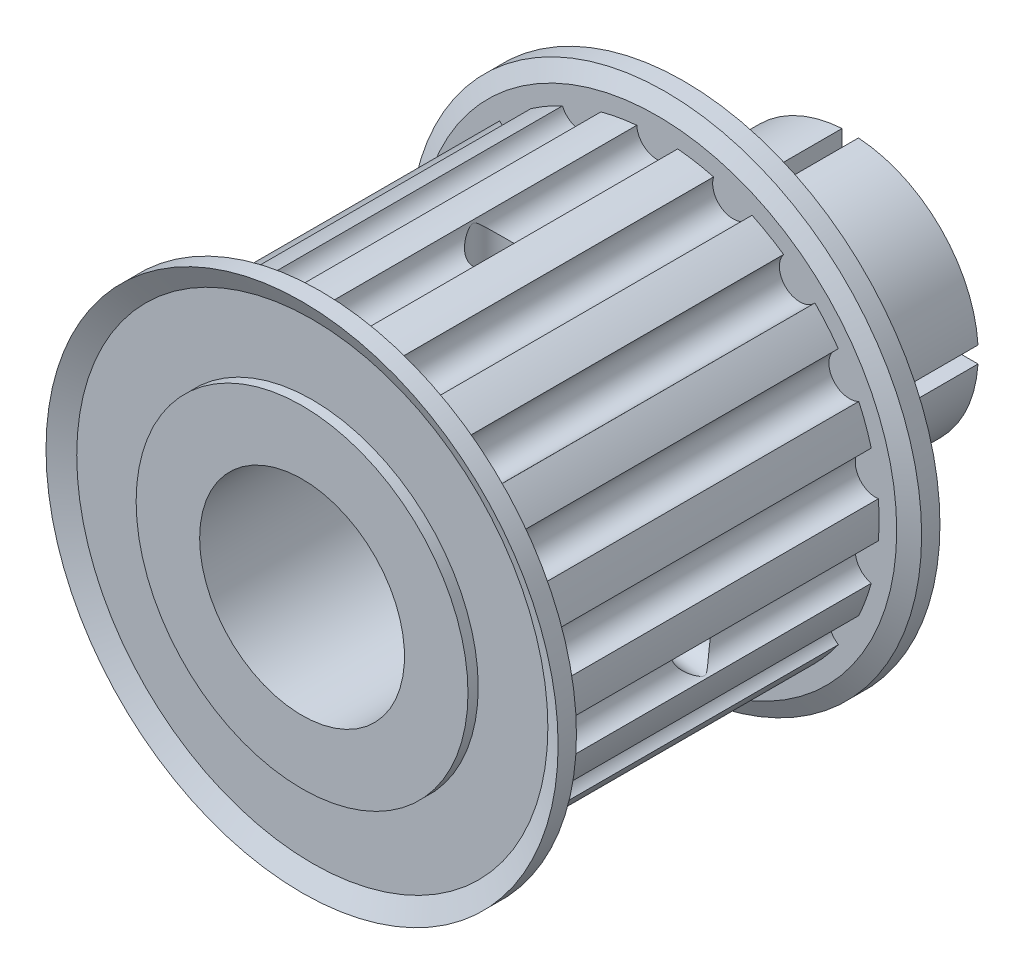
ISO-10303-21;
HEADER;
FILE_DESCRIPTION(('STEP AP214'),'2;1');
FILE_NAME('part.step','',(''),(''),'','','');
FILE_SCHEMA(('AUTOMOTIVE_DESIGN { 1 0 10303 214 1 1 1 1 }'));
ENDSEC;
DATA;
#1=APPLICATION_CONTEXT('core data for automotive mechanical design processes');
#2=APPLICATION_PROTOCOL_DEFINITION('international standard','automotive_design',2000,#1);
#3=PRODUCT_CONTEXT('',#1,'mechanical');
#4=PRODUCT('Part','Part','',(#3));
#5=PRODUCT_RELATED_PRODUCT_CATEGORY('part','',(#4));
#6=PRODUCT_DEFINITION_FORMATION('','',#4);
#7=PRODUCT_DEFINITION_CONTEXT('part definition',#1,'design');
#8=PRODUCT_DEFINITION('design','',#6,#7);
#9=PRODUCT_DEFINITION_SHAPE('','',#8);
#10=(LENGTH_UNIT() NAMED_UNIT(*) SI_UNIT(.MILLI.,.METRE.));
#11=(NAMED_UNIT(*) PLANE_ANGLE_UNIT() SI_UNIT($,.RADIAN.));
#12=(NAMED_UNIT(*) SI_UNIT($,.STERADIAN.) SOLID_ANGLE_UNIT());
#13=UNCERTAINTY_MEASURE_WITH_UNIT(LENGTH_MEASURE(1.E-05),#10,'distance_accuracy_value','');
#14=(GEOMETRIC_REPRESENTATION_CONTEXT(3) GLOBAL_UNCERTAINTY_ASSIGNED_CONTEXT((#13)) GLOBAL_UNIT_ASSIGNED_CONTEXT((#10,
#11,#12)) REPRESENTATION_CONTEXT('',''));
#15=CARTESIAN_POINT('',(0.,0.,0.));
#16=DIRECTION('',(0.,0.,1.));
#17=DIRECTION('',(1.,0.,0.));
#18=AXIS2_PLACEMENT_3D('',#15,#16,#17);
#19=CARTESIAN_POINT('',(-0.507999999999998,80.7211999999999,23.7744));
#20=DIRECTION('',(0.,-1.,0.));
#21=DIRECTION('',(-1.,0.,0.));
#22=AXIS2_PLACEMENT_3D('',#19,#20,#21);
#23=PLANE('',#22);
#24=DIRECTION('',(0.,0.,1.));
#25=VECTOR('',#24,1.);
#26=CARTESIAN_POINT('',(-6.32964738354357,80.7211999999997,4.72439999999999));
#27=LINE('',#26,#25);
#28=CARTESIAN_POINT('',(-6.32964738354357,80.7211999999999,23.7744));
#29=VERTEX_POINT('',#28);
#30=CARTESIAN_POINT('',(-6.32964738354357,80.7211999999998,13.462));
#31=VERTEX_POINT('',#30);
#32=EDGE_CURVE('E385',#29,#31,#27,.F.);
#33=ORIENTED_EDGE('',*,*,#32,.T.);
#34=DIRECTION('',(-1.,0.,0.));
#35=VECTOR('',#34,1.);
#36=CARTESIAN_POINT('',(-0.507999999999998,80.7211999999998,13.462));
#37=LINE('',#36,#35);
#38=CARTESIAN_POINT('',(-7.92122731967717,80.7211999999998,13.462));
#39=VERTEX_POINT('',#38);
#40=EDGE_CURVE('E372',#31,#39,#37,.T.);
#41=ORIENTED_EDGE('',*,*,#40,.T.);
#42=DIRECTION('',(0.,0.,1.));
#43=VECTOR('',#42,1.);
#44=CARTESIAN_POINT('',(-7.92122731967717,80.7211999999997,4.72439999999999));
#45=LINE('',#44,#43);
#46=CARTESIAN_POINT('',(-7.92122731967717,80.7211999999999,23.7744));
#47=VERTEX_POINT('',#46);
#48=EDGE_CURVE('E383',#47,#39,#45,.F.);
#49=ORIENTED_EDGE('',*,*,#48,.F.);
#50=DIRECTION('',(-1.,0.,0.));
#51=VECTOR('',#50,1.);
#52=CARTESIAN_POINT('',(-0.507999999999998,80.7211999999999,23.7744));
#53=LINE('',#52,#51);
#54=EDGE_CURVE('E667',#29,#47,#53,.T.);
#55=ORIENTED_EDGE('',*,*,#54,.F.);
#56=EDGE_LOOP('',(#33,#41,#49,#55));
#57=FACE_BOUND('',#56,.T.);
#58=ADVANCED_FACE('F43',(#57),#23,.F.);
#59=CARTESIAN_POINT('',(-0.507999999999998,81.7371999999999,23.7744));
#60=DIRECTION('',(0.,1.,0.));
#61=DIRECTION('',(0.,0.,1.));
#62=AXIS2_PLACEMENT_3D('',#59,#60,#61);
#63=PLANE('',#62);
#64=DIRECTION('',(0.,0.,1.));
#65=VECTOR('',#64,1.);
#66=CARTESIAN_POINT('',(-7.92122731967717,81.7371999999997,4.72439999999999));
#67=LINE('',#66,#65);
#68=CARTESIAN_POINT('',(-7.92122731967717,81.7371999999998,13.462));
#69=VERTEX_POINT('',#68);
#70=CARTESIAN_POINT('',(-7.92122731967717,81.7371999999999,23.7744));
#71=VERTEX_POINT('',#70);
#72=EDGE_CURVE('E392',#69,#71,#67,.T.);
#73=ORIENTED_EDGE('',*,*,#72,.F.);
#74=DIRECTION('',(1.,0.,0.));
#75=VECTOR('',#74,1.);
#76=CARTESIAN_POINT('',(-0.507999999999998,81.7371999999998,13.462));
#77=LINE('',#76,#75);
#78=CARTESIAN_POINT('',(-6.32964738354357,81.7371999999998,13.462));
#79=VERTEX_POINT('',#78);
#80=EDGE_CURVE('E58',#69,#79,#77,.T.);
#81=ORIENTED_EDGE('',*,*,#80,.T.);
#82=DIRECTION('',(0.,0.,1.));
#83=VECTOR('',#82,1.);
#84=CARTESIAN_POINT('',(-6.32964738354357,81.7371999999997,4.72439999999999));
#85=LINE('',#84,#83);
#86=CARTESIAN_POINT('',(-6.32964738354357,81.7371999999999,23.7744));
#87=VERTEX_POINT('',#86);
#88=EDGE_CURVE('E421',#79,#87,#85,.T.);
#89=ORIENTED_EDGE('',*,*,#88,.T.);
#90=DIRECTION('',(1.,0.,0.));
#91=VECTOR('',#90,1.);
#92=CARTESIAN_POINT('',(-0.507999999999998,81.7371999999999,23.7744));
#93=LINE('',#92,#91);
#94=EDGE_CURVE('E662',#71,#87,#93,.T.);
#95=ORIENTED_EDGE('',*,*,#94,.F.);
#96=EDGE_LOOP('',(#73,#81,#89,#95));
#97=FACE_BOUND('',#96,.T.);
#98=ADVANCED_FACE('F471',(#97),#63,.F.);
#99=CARTESIAN_POINT('',(0.508,65.3541999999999,23.7744000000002));
#100=DIRECTION('',(1.,0.,0.));
#101=DIRECTION('',(0.,-1.,0.));
#102=AXIS2_PLACEMENT_3D('',#99,#100,#101);
#103=PLANE('',#102);
#104=DIRECTION('',(0.,0.,1.));
#105=VECTOR('',#104,1.);
#106=CARTESIAN_POINT('',(0.507999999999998,74.8995526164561,4.72440000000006));
#107=LINE('',#106,#105);
#108=CARTESIAN_POINT('',(0.507999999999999,74.8995526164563,23.7744000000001));
#109=VERTEX_POINT('',#108);
#110=CARTESIAN_POINT('',(0.507999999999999,74.8995526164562,13.4620000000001));
#111=VERTEX_POINT('',#110);
#112=EDGE_CURVE('E418',#109,#111,#107,.F.);
#113=ORIENTED_EDGE('',*,*,#112,.T.);
#114=DIRECTION('',(0.,-1.,0.));
#115=VECTOR('',#114,1.);
#116=CARTESIAN_POINT('',(0.508,65.3541999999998,13.4620000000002));
#117=LINE('',#116,#115);
#118=CARTESIAN_POINT('',(0.507999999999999,73.3079726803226,13.4620000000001));
#119=VERTEX_POINT('',#118);
#120=EDGE_CURVE('E1066',#111,#119,#117,.T.);
#121=ORIENTED_EDGE('',*,*,#120,.T.);
#122=DIRECTION('',(0.,0.,1.));
#123=VECTOR('',#122,1.);
#124=CARTESIAN_POINT('',(0.507999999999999,73.3079726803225,4.72440000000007));
#125=LINE('',#124,#123);
#126=CARTESIAN_POINT('',(0.507999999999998,73.3079726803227,23.7744000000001));
#127=VERTEX_POINT('',#126);
#128=EDGE_CURVE('E397',#127,#119,#125,.F.);
#129=ORIENTED_EDGE('',*,*,#128,.F.);
#130=DIRECTION('',(0.,-1.,0.));
#131=VECTOR('',#130,1.);
#132=CARTESIAN_POINT('',(0.508,65.3541999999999,23.7744000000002));
#133=LINE('',#132,#131);
#134=EDGE_CURVE('E1043',#109,#127,#133,.T.);
#135=ORIENTED_EDGE('',*,*,#134,.F.);
#136=EDGE_LOOP('',(#113,#121,#129,#135));
#137=FACE_BOUND('',#136,.T.);
#138=ADVANCED_FACE('F474',(#137),#103,.F.);
#139=CARTESIAN_POINT('',(-0.508,65.3541999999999,23.7744000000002));
#140=DIRECTION('',(-1.,0.,0.));
#141=DIRECTION('',(0.,1.,0.));
#142=AXIS2_PLACEMENT_3D('',#139,#140,#141);
#143=PLANE('',#142);
#144=DIRECTION('',(0.,0.,1.));
#145=VECTOR('',#144,1.);
#146=CARTESIAN_POINT('',(-0.507999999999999,73.3079726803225,4.72440000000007));
#147=LINE('',#146,#145);
#148=CARTESIAN_POINT('',(-0.507999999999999,73.3079726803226,13.4620000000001));
#149=VERTEX_POINT('',#148);
#150=CARTESIAN_POINT('',(-0.507999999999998,73.3079726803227,23.7744000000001));
#151=VERTEX_POINT('',#150);
#152=EDGE_CURVE('E1093',#149,#151,#147,.T.);
#153=ORIENTED_EDGE('',*,*,#152,.F.);
#154=DIRECTION('',(0.,1.,0.));
#155=VECTOR('',#154,1.);
#156=CARTESIAN_POINT('',(-0.508,65.3541999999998,13.4620000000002));
#157=LINE('',#156,#155);
#158=CARTESIAN_POINT('',(-0.507999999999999,74.8995526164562,13.4620000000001));
#159=VERTEX_POINT('',#158);
#160=EDGE_CURVE('E375',#149,#159,#157,.T.);
#161=ORIENTED_EDGE('',*,*,#160,.T.);
#162=DIRECTION('',(0.,0.,1.));
#163=VECTOR('',#162,1.);
#164=CARTESIAN_POINT('',(-0.507999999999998,74.8995526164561,4.72440000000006));
#165=LINE('',#164,#163);
#166=CARTESIAN_POINT('',(-0.507999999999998,74.8995526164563,23.7744000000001));
#167=VERTEX_POINT('',#166);
#168=EDGE_CURVE('E413',#159,#167,#165,.T.);
#169=ORIENTED_EDGE('',*,*,#168,.T.);
#170=DIRECTION('',(0.,1.,0.));
#171=VECTOR('',#170,1.);
#172=CARTESIAN_POINT('',(-0.508,65.3541999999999,23.7744000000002));
#173=LINE('',#172,#171);
#174=EDGE_CURVE('E1048',#151,#167,#173,.T.);
#175=ORIENTED_EDGE('',*,*,#174,.F.);
#176=EDGE_LOOP('',(#153,#161,#169,#175));
#177=FACE_BOUND('',#176,.T.);
#178=ADVANCED_FACE('F478',(#177),#143,.F.);
#179=CARTESIAN_POINT('',(15.875,80.7211999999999,23.7744));
#180=DIRECTION('',(0.,-1.,0.));
#181=DIRECTION('',(-1.,0.,0.));
#182=AXIS2_PLACEMENT_3D('',#179,#180,#181);
#183=PLANE('',#182);
#184=DIRECTION('',(0.,0.,1.));
#185=VECTOR('',#184,1.);
#186=CARTESIAN_POINT('',(7.92122731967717,80.7211999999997,4.72439999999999));
#187=LINE('',#186,#185);
#188=CARTESIAN_POINT('',(7.92122731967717,80.7211999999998,13.462));
#189=VERTEX_POINT('',#188);
#190=CARTESIAN_POINT('',(7.92122731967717,80.7211999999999,23.7744));
#191=VERTEX_POINT('',#190);
#192=EDGE_CURVE('E1091',#189,#191,#187,.T.);
#193=ORIENTED_EDGE('',*,*,#192,.F.);
#194=DIRECTION('',(-1.,0.,0.));
#195=VECTOR('',#194,1.);
#196=CARTESIAN_POINT('',(15.875,80.7211999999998,13.462));
#197=LINE('',#196,#195);
#198=CARTESIAN_POINT('',(6.32964738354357,80.7211999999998,13.462));
#199=VERTEX_POINT('',#198);
#200=EDGE_CURVE('E1060',#189,#199,#197,.T.);
#201=ORIENTED_EDGE('',*,*,#200,.T.);
#202=DIRECTION('',(0.,0.,1.));
#203=VECTOR('',#202,1.);
#204=CARTESIAN_POINT('',(6.32964738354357,80.7211999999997,4.72439999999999));
#205=LINE('',#204,#203);
#206=CARTESIAN_POINT('',(6.32964738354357,80.7211999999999,23.7744));
#207=VERTEX_POINT('',#206);
#208=EDGE_CURVE('E411',#199,#207,#205,.T.);
#209=ORIENTED_EDGE('',*,*,#208,.T.);
#210=DIRECTION('',(-1.,0.,0.));
#211=VECTOR('',#210,1.);
#212=CARTESIAN_POINT('',(15.875,80.7211999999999,23.7744));
#213=LINE('',#212,#211);
#214=EDGE_CURVE('E1041',#191,#207,#213,.T.);
#215=ORIENTED_EDGE('',*,*,#214,.F.);
#216=EDGE_LOOP('',(#193,#201,#209,#215));
#217=FACE_BOUND('',#216,.T.);
#218=ADVANCED_FACE('F461',(#217),#183,.F.);
#219=CARTESIAN_POINT('',(15.875,81.7371999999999,23.7744));
#220=DIRECTION('',(0.,1.,0.));
#221=DIRECTION('',(0.,0.,1.));
#222=AXIS2_PLACEMENT_3D('',#219,#220,#221);
#223=PLANE('',#222);
#224=DIRECTION('',(0.,0.,1.));
#225=VECTOR('',#224,1.);
#226=CARTESIAN_POINT('',(6.32964738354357,81.7371999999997,4.72439999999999));
#227=LINE('',#226,#225);
#228=CARTESIAN_POINT('',(6.32964738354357,81.7371999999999,23.7744));
#229=VERTEX_POINT('',#228);
#230=CARTESIAN_POINT('',(6.32964738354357,81.7371999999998,13.462));
#231=VERTEX_POINT('',#230);
#232=EDGE_CURVE('E405',#229,#231,#227,.F.);
#233=ORIENTED_EDGE('',*,*,#232,.T.);
#234=DIRECTION('',(1.,0.,0.));
#235=VECTOR('',#234,1.);
#236=CARTESIAN_POINT('',(15.875,81.7371999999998,13.462));
#237=LINE('',#236,#235);
#238=CARTESIAN_POINT('',(7.92122731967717,81.7371999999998,13.462));
#239=VERTEX_POINT('',#238);
#240=EDGE_CURVE('E1073',#231,#239,#237,.T.);
#241=ORIENTED_EDGE('',*,*,#240,.T.);
#242=DIRECTION('',(0.,0.,1.));
#243=VECTOR('',#242,1.);
#244=CARTESIAN_POINT('',(7.92122731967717,81.7371999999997,4.72439999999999));
#245=LINE('',#244,#243);
#246=CARTESIAN_POINT('',(7.92122731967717,81.7371999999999,23.7744));
#247=VERTEX_POINT('',#246);
#248=EDGE_CURVE('E1089',#247,#239,#245,.F.);
#249=ORIENTED_EDGE('',*,*,#248,.F.);
#250=DIRECTION('',(1.,0.,0.));
#251=VECTOR('',#250,1.);
#252=CARTESIAN_POINT('',(15.875,81.7371999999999,23.7744));
#253=LINE('',#252,#251);
#254=EDGE_CURVE('E664',#229,#247,#253,.T.);
#255=ORIENTED_EDGE('',*,*,#254,.F.);
#256=EDGE_LOOP('',(#233,#241,#249,#255));
#257=FACE_BOUND('',#256,.T.);
#258=ADVANCED_FACE('F457',(#257),#223,.F.);
#259=CARTESIAN_POINT('',(0.507999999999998,81.7371999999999,23.7744));
#260=DIRECTION('',(1.,0.,0.));
#261=DIRECTION('',(0.,-1.,0.));
#262=AXIS2_PLACEMENT_3D('',#259,#260,#261);
#263=PLANE('',#262);
#264=DIRECTION('',(0.,0.,1.));
#265=VECTOR('',#264,1.);
#266=CARTESIAN_POINT('',(0.507999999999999,89.1504273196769,4.72439999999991));
#267=LINE('',#266,#265);
#268=CARTESIAN_POINT('',(0.507999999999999,89.1504273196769,13.4619999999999));
#269=VERTEX_POINT('',#268);
#270=CARTESIAN_POINT('',(0.507999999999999,89.150427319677,23.7743999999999));
#271=VERTEX_POINT('',#270);
#272=EDGE_CURVE('E1087',#269,#271,#267,.T.);
#273=ORIENTED_EDGE('',*,*,#272,.F.);
#274=DIRECTION('',(0.,-1.,0.));
#275=VECTOR('',#274,1.);
#276=CARTESIAN_POINT('',(0.507999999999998,81.7371999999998,13.462));
#277=LINE('',#276,#275);
#278=CARTESIAN_POINT('',(0.507999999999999,87.5588473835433,13.4619999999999));
#279=VERTEX_POINT('',#278);
#280=EDGE_CURVE('E66',#269,#279,#277,.T.);
#281=ORIENTED_EDGE('',*,*,#280,.T.);
#282=DIRECTION('',(0.,0.,1.));
#283=VECTOR('',#282,1.);
#284=CARTESIAN_POINT('',(0.507999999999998,87.5588473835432,4.72439999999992));
#285=LINE('',#284,#283);
#286=CARTESIAN_POINT('',(0.507999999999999,87.5588473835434,23.7743999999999));
#287=VERTEX_POINT('',#286);
#288=EDGE_CURVE('E403',#279,#287,#285,.T.);
#289=ORIENTED_EDGE('',*,*,#288,.T.);
#290=DIRECTION('',(0.,-1.,0.));
#291=VECTOR('',#290,1.);
#292=CARTESIAN_POINT('',(0.507999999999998,81.7371999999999,23.7744));
#293=LINE('',#292,#291);
#294=EDGE_CURVE('E655',#271,#287,#293,.T.);
#295=ORIENTED_EDGE('',*,*,#294,.F.);
#296=EDGE_LOOP('',(#273,#281,#289,#295));
#297=FACE_BOUND('',#296,.T.);
#298=ADVANCED_FACE('F460',(#297),#263,.F.);
#299=CARTESIAN_POINT('',(-0.507999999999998,81.7371999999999,23.7744));
#300=DIRECTION('',(-1.,0.,0.));
#301=DIRECTION('',(0.,1.,0.));
#302=AXIS2_PLACEMENT_3D('',#299,#300,#301);
#303=PLANE('',#302);
#304=DIRECTION('',(0.,0.,1.));
#305=VECTOR('',#304,1.);
#306=CARTESIAN_POINT('',(-0.507999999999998,87.5588473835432,4.72439999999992));
#307=LINE('',#306,#305);
#308=CARTESIAN_POINT('',(-0.507999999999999,87.5588473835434,23.7743999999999));
#309=VERTEX_POINT('',#308);
#310=CARTESIAN_POINT('',(-0.507999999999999,87.5588473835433,13.4619999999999));
#311=VERTEX_POINT('',#310);
#312=EDGE_CURVE('E395',#309,#311,#307,.F.);
#313=ORIENTED_EDGE('',*,*,#312,.T.);
#314=DIRECTION('',(0.,1.,0.));
#315=VECTOR('',#314,1.);
#316=CARTESIAN_POINT('',(-0.507999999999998,81.7371999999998,13.462));
#317=LINE('',#316,#315);
#318=CARTESIAN_POINT('',(-0.507999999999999,89.1504273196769,13.4619999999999));
#319=VERTEX_POINT('',#318);
#320=EDGE_CURVE('E1074',#311,#319,#317,.T.);
#321=ORIENTED_EDGE('',*,*,#320,.T.);
#322=DIRECTION('',(0.,0.,1.));
#323=VECTOR('',#322,1.);
#324=CARTESIAN_POINT('',(-0.507999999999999,89.1504273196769,4.72439999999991));
#325=LINE('',#324,#323);
#326=CARTESIAN_POINT('',(-0.507999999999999,89.150427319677,23.7743999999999));
#327=VERTEX_POINT('',#326);
#328=EDGE_CURVE('E661',#327,#319,#325,.F.);
#329=ORIENTED_EDGE('',*,*,#328,.F.);
#330=DIRECTION('',(0.,1.,0.));
#331=VECTOR('',#330,1.);
#332=CARTESIAN_POINT('',(-0.507999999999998,81.7371999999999,23.7744));
#333=LINE('',#332,#331);
#334=EDGE_CURVE('E652',#309,#327,#333,.T.);
#335=ORIENTED_EDGE('',*,*,#334,.F.);
#336=EDGE_LOOP('',(#313,#321,#329,#335));
#337=FACE_BOUND('',#336,.T.);
#338=ADVANCED_FACE('F465',(#337),#303,.F.);
#339=CARTESIAN_POINT('',(0.,81.2291999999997,3.58925127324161));
#340=DIRECTION('',(0.,0.,-1.));
#341=DIRECTION('',(1.,0.,0.));
#342=AXIS2_PLACEMENT_3D('',#339,#340,#341);
#343=CYLINDRICAL_SURFACE('',#342,13.7541);
#344=CARTESIAN_POINT('',(0.,81.2291999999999,25.4254));
#345=DIRECTION('',(0.,0.,-1.));
#346=DIRECTION('',(1.,0.,0.));
#347=AXIS2_PLACEMENT_3D('',#344,#345,#346);
#348=CIRCLE('',#347,13.7541);
#349=CARTESIAN_POINT('',(7.83143717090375,69.9223941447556,25.4254000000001));
#350=VERTEX_POINT('',#349);
#351=CARTESIAN_POINT('',(5.87626252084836,68.7935735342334,25.4254000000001));
#352=VERTEX_POINT('',#351);
#353=EDGE_CURVE('E624',#350,#352,#348,.T.);
#354=ORIENTED_EDGE('',*,*,#353,.F.);
#355=DIRECTION('',(0.,0.,-1.));
#356=VECTOR('',#355,1.);
#357=CARTESIAN_POINT('',(7.83143717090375,69.9223941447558,48.7998875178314));
#358=LINE('',#357,#356);
#359=CARTESIAN_POINT('',(7.83143717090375,69.9223941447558,45.7962000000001));
#360=VERTEX_POINT('',#359);
#361=EDGE_CURVE('E515',#360,#350,#358,.T.);
#362=ORIENTED_EDGE('',*,*,#361,.F.);
#363=CARTESIAN_POINT('',(0.,81.2292000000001,45.7962));
#364=DIRECTION('',(0.,0.,-1.));
#365=DIRECTION('',(1.,0.,0.));
#366=AXIS2_PLACEMENT_3D('',#363,#364,#365);
#367=CIRCLE('',#366,13.7541);
#368=CARTESIAN_POINT('',(5.87626252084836,68.7935735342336,45.7962000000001));
#369=VERTEX_POINT('',#368);
#370=EDGE_CURVE('E846',#360,#369,#367,.T.);
#371=ORIENTED_EDGE('',*,*,#370,.T.);
#372=DIRECTION('',(0.,0.,-1.));
#373=VECTOR('',#372,1.);
#374=CARTESIAN_POINT('',(5.87626252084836,68.7935735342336,48.7427791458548));
#375=LINE('',#374,#373);
#376=EDGE_CURVE('E814',#369,#352,#375,.T.);
#377=ORIENTED_EDGE('',*,*,#376,.T.);
#378=EDGE_LOOP('',(#354,#362,#371,#377));
#379=FACE_BOUND('',#378,.T.);
#380=ADVANCED_FACE('F469',(#379),#343,.T.);
#381=CARTESIAN_POINT('',(11.2262990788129,73.2827872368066,45.7962000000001));
#382=VERTEX_POINT('',#381);
#383=CARTESIAN_POINT('',(9.77511527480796,71.5533337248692,45.7962000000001));
#384=VERTEX_POINT('',#383);
#385=EDGE_CURVE('E851',#382,#384,#367,.T.);
#386=ORIENTED_EDGE('',*,*,#385,.T.);
#387=DIRECTION('',(0.,0.,-1.));
#388=VECTOR('',#387,1.);
#389=CARTESIAN_POINT('',(9.77511527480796,71.5533337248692,48.7998875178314));
#390=LINE('',#389,#388);
#391=CARTESIAN_POINT('',(9.77511527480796,71.5533337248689,25.4254000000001));
#392=VERTEX_POINT('',#391);
#393=EDGE_CURVE('E682',#384,#392,#390,.T.);
#394=ORIENTED_EDGE('',*,*,#393,.T.);
#395=CARTESIAN_POINT('',(11.2262990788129,73.2827872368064,25.4254000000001));
#396=VERTEX_POINT('',#395);
#397=EDGE_CURVE('E936',#396,#392,#348,.T.);
#398=ORIENTED_EDGE('',*,*,#397,.F.);
#399=DIRECTION('',(0.,0.,-1.));
#400=VECTOR('',#399,1.);
#401=CARTESIAN_POINT('',(11.2262990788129,73.2827872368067,48.7808686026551));
#402=LINE('',#401,#400);
#403=EDGE_CURVE('E680',#382,#396,#402,.T.);
#404=ORIENTED_EDGE('',*,*,#403,.F.);
#405=EDGE_LOOP('',(#386,#394,#398,#404));
#406=FACE_BOUND('',#405,.T.);
#407=ADVANCED_FACE('F922',(#406),#343,.T.);
#408=CARTESIAN_POINT('',(13.2671036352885,77.6016349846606,45.7962));
#409=VERTEX_POINT('',#408);
#410=CARTESIAN_POINT('',(12.4949448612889,75.4801461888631,45.7962000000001));
#411=VERTEX_POINT('',#410);
#412=EDGE_CURVE('E910',#409,#411,#367,.T.);
#413=ORIENTED_EDGE('',*,*,#412,.T.);
#414=DIRECTION('',(0.,0.,-1.));
#415=VECTOR('',#414,1.);
#416=CARTESIAN_POINT('',(12.4949448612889,75.4801461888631,48.780868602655));
#417=LINE('',#416,#415);
#418=CARTESIAN_POINT('',(12.4949448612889,75.4801461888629,25.4254000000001));
#419=VERTEX_POINT('',#418);
#420=EDGE_CURVE('E691',#411,#419,#417,.T.);
#421=ORIENTED_EDGE('',*,*,#420,.T.);
#422=CARTESIAN_POINT('',(13.2671036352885,77.6016349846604,25.4254));
#423=VERTEX_POINT('',#422);
#424=EDGE_CURVE('E618',#423,#419,#348,.T.);
#425=ORIENTED_EDGE('',*,*,#424,.F.);
#426=DIRECTION('',(0.,0.,-1.));
#427=VECTOR('',#426,1.);
#428=CARTESIAN_POINT('',(13.2671036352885,77.6016349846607,48.6855342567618));
#429=LINE('',#428,#427);
#430=EDGE_CURVE('E689',#409,#423,#429,.T.);
#431=ORIENTED_EDGE('',*,*,#430,.F.);
#432=EDGE_LOOP('',(#413,#421,#425,#431));
#433=FACE_BOUND('',#432,.T.);
#434=ADVANCED_FACE('F989',(#433),#343,.T.);
#435=CARTESIAN_POINT('',(13.7076996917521,82.3580206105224,45.7962));
#436=VERTEX_POINT('',#435);
#437=CARTESIAN_POINT('',(13.7076996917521,80.100379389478,45.7962));
#438=VERTEX_POINT('',#437);
#439=EDGE_CURVE('E908',#436,#438,#367,.T.);
#440=ORIENTED_EDGE('',*,*,#439,.T.);
#441=DIRECTION('',(0.,0.,-1.));
#442=VECTOR('',#441,1.);
#443=CARTESIAN_POINT('',(13.7076996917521,80.100379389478,48.6855342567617));
#444=LINE('',#443,#442);
#445=CARTESIAN_POINT('',(13.7076996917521,80.1003793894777,25.4254));
#446=VERTEX_POINT('',#445);
#447=EDGE_CURVE('E700',#438,#446,#444,.T.);
#448=ORIENTED_EDGE('',*,*,#447,.T.);
#449=CARTESIAN_POINT('',(13.7076996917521,82.3580206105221,25.4254));
#450=VERTEX_POINT('',#449);
#451=EDGE_CURVE('E614',#450,#446,#348,.T.);
#452=ORIENTED_EDGE('',*,*,#451,.F.);
#453=DIRECTION('',(0.,0.,-1.));
#454=VECTOR('',#453,1.);
#455=CARTESIAN_POINT('',(13.7076996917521,82.3580206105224,48.6855342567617));
#456=LINE('',#455,#454);
#457=EDGE_CURVE('E698',#436,#450,#456,.T.);
#458=ORIENTED_EDGE('',*,*,#457,.F.);
#459=EDGE_LOOP('',(#440,#448,#452,#458));
#460=FACE_BOUND('',#459,.T.);
#461=ADVANCED_FACE('F984',(#460),#343,.T.);
#462=CARTESIAN_POINT('',(12.4949448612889,86.9782538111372,45.7961999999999));
#463=VERTEX_POINT('',#462);
#464=CARTESIAN_POINT('',(13.2671036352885,84.8567650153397,45.7962));
#465=VERTEX_POINT('',#464);
#466=EDGE_CURVE('E904',#463,#465,#367,.T.);
#467=ORIENTED_EDGE('',*,*,#466,.T.);
#468=DIRECTION('',(0.,0.,-1.));
#469=VECTOR('',#468,1.);
#470=CARTESIAN_POINT('',(13.2671036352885,84.8567650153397,48.6855342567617));
#471=LINE('',#470,#469);
#472=CARTESIAN_POINT('',(13.2671036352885,84.8567650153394,25.4254));
#473=VERTEX_POINT('',#472);
#474=EDGE_CURVE('E613',#465,#473,#471,.T.);
#475=ORIENTED_EDGE('',*,*,#474,.T.);
#476=CARTESIAN_POINT('',(12.4949448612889,86.978253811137,25.4253999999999));
#477=VERTEX_POINT('',#476);
#478=EDGE_CURVE('E604',#477,#473,#348,.T.);
#479=ORIENTED_EDGE('',*,*,#478,.F.);
#480=DIRECTION('',(0.,0.,-1.));
#481=VECTOR('',#480,1.);
#482=CARTESIAN_POINT('',(12.4949448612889,86.9782538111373,48.7808686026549));
#483=LINE('',#482,#481);
#484=EDGE_CURVE('E585',#463,#477,#483,.T.);
#485=ORIENTED_EDGE('',*,*,#484,.F.);
#486=EDGE_LOOP('',(#467,#475,#479,#485));
#487=FACE_BOUND('',#486,.T.);
#488=ADVANCED_FACE('F611',(#487),#343,.T.);
#489=CARTESIAN_POINT('',(9.7751152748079,90.9050662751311,45.7961999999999));
#490=VERTEX_POINT('',#489);
#491=CARTESIAN_POINT('',(11.2262990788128,89.1756127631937,45.7961999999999));
#492=VERTEX_POINT('',#491);
#493=EDGE_CURVE('E899',#490,#492,#367,.T.);
#494=ORIENTED_EDGE('',*,*,#493,.T.);
#495=DIRECTION('',(0.,0.,-1.));
#496=VECTOR('',#495,1.);
#497=CARTESIAN_POINT('',(11.2262990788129,89.1756127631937,48.7808686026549));
#498=LINE('',#497,#496);
#499=CARTESIAN_POINT('',(11.2262990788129,89.1756127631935,25.4253999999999));
#500=VERTEX_POINT('',#499);
#501=EDGE_CURVE('E596',#492,#500,#498,.T.);
#502=ORIENTED_EDGE('',*,*,#501,.T.);
#503=CARTESIAN_POINT('',(9.7751152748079,90.9050662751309,25.4253999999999));
#504=VERTEX_POINT('',#503);
#505=EDGE_CURVE('E607',#504,#500,#348,.T.);
#506=ORIENTED_EDGE('',*,*,#505,.F.);
#507=DIRECTION('',(0.,0.,-1.));
#508=VECTOR('',#507,1.);
#509=CARTESIAN_POINT('',(9.7751152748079,90.9050662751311,48.7998875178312));
#510=LINE('',#509,#508);
#511=EDGE_CURVE('E608',#490,#504,#510,.T.);
#512=ORIENTED_EDGE('',*,*,#511,.F.);
#513=EDGE_LOOP('',(#494,#502,#506,#512));
#514=FACE_BOUND('',#513,.T.);
#515=ADVANCED_FACE('F981',(#514),#343,.T.);
#516=CARTESIAN_POINT('',(5.87626252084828,93.6648264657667,45.7961999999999));
#517=VERTEX_POINT('',#516);
#518=CARTESIAN_POINT('',(7.83143717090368,92.5360058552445,45.7961999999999));
#519=VERTEX_POINT('',#518);
#520=EDGE_CURVE('E894',#517,#519,#367,.T.);
#521=ORIENTED_EDGE('',*,*,#520,.T.);
#522=DIRECTION('',(0.,0.,-1.));
#523=VECTOR('',#522,1.);
#524=CARTESIAN_POINT('',(7.83143717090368,92.5360058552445,48.7998875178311));
#525=LINE('',#524,#523);
#526=CARTESIAN_POINT('',(7.83143717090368,92.5360058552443,25.4253999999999));
#527=VERTEX_POINT('',#526);
#528=EDGE_CURVE('E716',#519,#527,#525,.T.);
#529=ORIENTED_EDGE('',*,*,#528,.T.);
#530=CARTESIAN_POINT('',(5.87626252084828,93.6648264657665,25.4253999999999));
#531=VERTEX_POINT('',#530);
#532=EDGE_CURVE('E616',#531,#527,#348,.T.);
#533=ORIENTED_EDGE('',*,*,#532,.F.);
#534=DIRECTION('',(0.,0.,-1.));
#535=VECTOR('',#534,1.);
#536=CARTESIAN_POINT('',(5.87626252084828,93.6648264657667,48.7427791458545));
#537=LINE('',#536,#535);
#538=EDGE_CURVE('E714',#517,#531,#537,.T.);
#539=ORIENTED_EDGE('',*,*,#538,.F.);
#540=EDGE_LOOP('',(#521,#529,#533,#539));
#541=FACE_BOUND('',#540,.T.);
#542=ADVANCED_FACE('F979',(#541),#343,.T.);
#543=CARTESIAN_POINT('',(1.26864578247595,94.9246665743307,45.7961999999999));
#544=VERTEX_POINT('',#543);
#545=CARTESIAN_POINT('',(3.49198836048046,94.5326312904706,45.7961999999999));
#546=VERTEX_POINT('',#545);
#547=EDGE_CURVE('E889',#544,#546,#367,.T.);
#548=ORIENTED_EDGE('',*,*,#547,.T.);
#549=DIRECTION('',(0.,0.,-1.));
#550=VECTOR('',#549,1.);
#551=CARTESIAN_POINT('',(3.49198836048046,94.5326312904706,48.7427791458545));
#552=LINE('',#551,#550);
#553=CARTESIAN_POINT('',(3.49198836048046,94.5326312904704,25.4253999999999));
#554=VERTEX_POINT('',#553);
#555=EDGE_CURVE('E725',#546,#554,#552,.T.);
#556=ORIENTED_EDGE('',*,*,#555,.T.);
#557=CARTESIAN_POINT('',(1.26864578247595,94.9246665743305,25.4253999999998));
#558=VERTEX_POINT('',#557);
#559=EDGE_CURVE('E971',#558,#554,#348,.T.);
#560=ORIENTED_EDGE('',*,*,#559,.F.);
#561=DIRECTION('',(0.,0.,-1.));
#562=VECTOR('',#561,1.);
#563=CARTESIAN_POINT('',(1.26864578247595,94.9246665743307,48.6335840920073));
#564=LINE('',#563,#562);
#565=EDGE_CURVE('E723',#544,#558,#564,.T.);
#566=ORIENTED_EDGE('',*,*,#565,.F.);
#567=EDGE_LOOP('',(#548,#556,#560,#566));
#568=FACE_BOUND('',#567,.T.);
#569=ADVANCED_FACE('F1232',(#568),#343,.T.);
#570=CARTESIAN_POINT('',(-3.49198836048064,94.5326312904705,45.7961999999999));
#571=VERTEX_POINT('',#570);
#572=CARTESIAN_POINT('',(-1.26864578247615,94.9246665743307,45.7961999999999));
#573=VERTEX_POINT('',#572);
#574=EDGE_CURVE('E884',#571,#573,#367,.T.);
#575=ORIENTED_EDGE('',*,*,#574,.T.);
#576=DIRECTION('',(0.,0.,-1.));
#577=VECTOR('',#576,1.);
#578=CARTESIAN_POINT('',(-1.26864578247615,94.9246665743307,48.6335840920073));
#579=LINE('',#578,#577);
#580=CARTESIAN_POINT('',(-1.26864578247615,94.9246665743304,25.4253999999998));
#581=VERTEX_POINT('',#580);
#582=EDGE_CURVE('E734',#573,#581,#579,.T.);
#583=ORIENTED_EDGE('',*,*,#582,.T.);
#584=CARTESIAN_POINT('',(-3.49198836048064,94.5326312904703,25.4253999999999));
#585=VERTEX_POINT('',#584);
#586=EDGE_CURVE('E967',#585,#581,#348,.T.);
#587=ORIENTED_EDGE('',*,*,#586,.F.);
#588=DIRECTION('',(0.,0.,-1.));
#589=VECTOR('',#588,1.);
#590=CARTESIAN_POINT('',(-3.49198836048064,94.5326312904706,48.7427791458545));
#591=LINE('',#590,#589);
#592=EDGE_CURVE('E732',#571,#585,#591,.T.);
#593=ORIENTED_EDGE('',*,*,#592,.F.);
#594=EDGE_LOOP('',(#575,#583,#587,#593));
#595=FACE_BOUND('',#594,.T.);
#596=ADVANCED_FACE('F1242',(#595),#343,.T.);
#597=CARTESIAN_POINT('',(-7.83143717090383,92.5360058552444,45.7961999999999));
#598=VERTEX_POINT('',#597);
#599=CARTESIAN_POINT('',(-5.87626252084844,93.6648264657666,45.7961999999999));
#600=VERTEX_POINT('',#599);
#601=EDGE_CURVE('E879',#598,#600,#367,.T.);
#602=ORIENTED_EDGE('',*,*,#601,.T.);
#603=DIRECTION('',(0.,0.,-1.));
#604=VECTOR('',#603,1.);
#605=CARTESIAN_POINT('',(-5.87626252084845,93.6648264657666,48.7427791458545));
#606=LINE('',#605,#604);
#607=CARTESIAN_POINT('',(-5.87626252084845,93.6648264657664,25.4253999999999));
#608=VERTEX_POINT('',#607);
#609=EDGE_CURVE('E743',#600,#608,#606,.T.);
#610=ORIENTED_EDGE('',*,*,#609,.T.);
#611=CARTESIAN_POINT('',(-7.83143717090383,92.5360058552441,25.4253999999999));
#612=VERTEX_POINT('',#611);
#613=EDGE_CURVE('E963',#612,#608,#348,.T.);
#614=ORIENTED_EDGE('',*,*,#613,.F.);
#615=DIRECTION('',(0.,0.,-1.));
#616=VECTOR('',#615,1.);
#617=CARTESIAN_POINT('',(-7.83143717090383,92.5360058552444,48.7998875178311));
#618=LINE('',#617,#616);
#619=EDGE_CURVE('E741',#598,#612,#618,.T.);
#620=ORIENTED_EDGE('',*,*,#619,.F.);
#621=EDGE_LOOP('',(#602,#610,#614,#620));
#622=FACE_BOUND('',#621,.T.);
#623=ADVANCED_FACE('F1252',(#622),#343,.T.);
#624=CARTESIAN_POINT('',(-11.226299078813,89.1756127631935,45.7961999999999));
#625=VERTEX_POINT('',#624);
#626=CARTESIAN_POINT('',(-9.77511527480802,90.905066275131,45.7961999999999));
#627=VERTEX_POINT('',#626);
#628=EDGE_CURVE('E874',#625,#627,#367,.T.);
#629=ORIENTED_EDGE('',*,*,#628,.T.);
#630=DIRECTION('',(0.,0.,-1.));
#631=VECTOR('',#630,1.);
#632=CARTESIAN_POINT('',(-9.77511527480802,90.905066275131,48.7998875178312));
#633=LINE('',#632,#631);
#634=CARTESIAN_POINT('',(-9.77511527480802,90.9050662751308,25.4253999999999));
#635=VERTEX_POINT('',#634);
#636=EDGE_CURVE('E752',#627,#635,#633,.T.);
#637=ORIENTED_EDGE('',*,*,#636,.T.);
#638=CARTESIAN_POINT('',(-11.226299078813,89.1756127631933,25.4253999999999));
#639=VERTEX_POINT('',#638);
#640=EDGE_CURVE('E959',#639,#635,#348,.T.);
#641=ORIENTED_EDGE('',*,*,#640,.F.);
#642=DIRECTION('',(0.,0.,-1.));
#643=VECTOR('',#642,1.);
#644=CARTESIAN_POINT('',(-11.226299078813,89.1756127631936,48.7808686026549));
#645=LINE('',#644,#643);
#646=EDGE_CURVE('E750',#625,#639,#645,.T.);
#647=ORIENTED_EDGE('',*,*,#646,.F.);
#648=EDGE_LOOP('',(#629,#637,#641,#647));
#649=FACE_BOUND('',#648,.T.);
#650=ADVANCED_FACE('F1262',(#649),#343,.T.);
#651=CARTESIAN_POINT('',(-13.2671036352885,84.8567650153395,45.7962));
#652=VERTEX_POINT('',#651);
#653=CARTESIAN_POINT('',(-12.494944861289,86.978253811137,45.7961999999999));
#654=VERTEX_POINT('',#653);
#655=EDGE_CURVE('E869',#652,#654,#367,.T.);
#656=ORIENTED_EDGE('',*,*,#655,.T.);
#657=DIRECTION('',(0.,0.,-1.));
#658=VECTOR('',#657,1.);
#659=CARTESIAN_POINT('',(-12.494944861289,86.9782538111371,48.7808686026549));
#660=LINE('',#659,#658);
#661=CARTESIAN_POINT('',(-12.494944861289,86.9782538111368,25.4253999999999));
#662=VERTEX_POINT('',#661);
#663=EDGE_CURVE('E761',#654,#662,#660,.T.);
#664=ORIENTED_EDGE('',*,*,#663,.T.);
#665=CARTESIAN_POINT('',(-13.2671036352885,84.8567650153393,25.4254));
#666=VERTEX_POINT('',#665);
#667=EDGE_CURVE('E955',#666,#662,#348,.T.);
#668=ORIENTED_EDGE('',*,*,#667,.F.);
#669=DIRECTION('',(0.,0.,-1.));
#670=VECTOR('',#669,1.);
#671=CARTESIAN_POINT('',(-13.2671036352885,84.8567650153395,48.6855342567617));
#672=LINE('',#671,#670);
#673=EDGE_CURVE('E759',#652,#666,#672,.T.);
#674=ORIENTED_EDGE('',*,*,#673,.F.);
#675=EDGE_LOOP('',(#656,#664,#668,#674));
#676=FACE_BOUND('',#675,.T.);
#677=ADVANCED_FACE('F1272',(#676),#343,.T.);
#678=CARTESIAN_POINT('',(-13.7076996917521,80.1003793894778,45.7962));
#679=VERTEX_POINT('',#678);
#680=CARTESIAN_POINT('',(-13.7076996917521,82.3580206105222,45.7962));
#681=VERTEX_POINT('',#680);
#682=EDGE_CURVE('E864',#679,#681,#367,.T.);
#683=ORIENTED_EDGE('',*,*,#682,.T.);
#684=DIRECTION('',(0.,0.,-1.));
#685=VECTOR('',#684,1.);
#686=CARTESIAN_POINT('',(-13.7076996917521,82.3580206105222,48.6855342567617));
#687=LINE('',#686,#685);
#688=CARTESIAN_POINT('',(-13.7076996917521,82.358020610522,25.4254));
#689=VERTEX_POINT('',#688);
#690=EDGE_CURVE('E770',#681,#689,#687,.T.);
#691=ORIENTED_EDGE('',*,*,#690,.T.);
#692=CARTESIAN_POINT('',(-13.7076996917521,80.1003793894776,25.4254));
#693=VERTEX_POINT('',#692);
#694=EDGE_CURVE('E951',#693,#689,#348,.T.);
#695=ORIENTED_EDGE('',*,*,#694,.F.);
#696=DIRECTION('',(0.,0.,-1.));
#697=VECTOR('',#696,1.);
#698=CARTESIAN_POINT('',(-13.7076996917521,80.1003793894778,48.6855342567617));
#699=LINE('',#698,#697);
#700=EDGE_CURVE('E768',#679,#693,#699,.T.);
#701=ORIENTED_EDGE('',*,*,#700,.F.);
#702=EDGE_LOOP('',(#683,#691,#695,#701));
#703=FACE_BOUND('',#702,.T.);
#704=ADVANCED_FACE('F1282',(#703),#343,.T.);
#705=CARTESIAN_POINT('',(-12.4949448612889,75.4801461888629,45.7962000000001));
#706=VERTEX_POINT('',#705);
#707=CARTESIAN_POINT('',(-13.2671036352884,77.6016349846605,45.7962));
#708=VERTEX_POINT('',#707);
#709=EDGE_CURVE('E859',#706,#708,#367,.T.);
#710=ORIENTED_EDGE('',*,*,#709,.T.);
#711=DIRECTION('',(0.,0.,-1.));
#712=VECTOR('',#711,1.);
#713=CARTESIAN_POINT('',(-13.2671036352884,77.6016349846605,48.6855342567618));
#714=LINE('',#713,#712);
#715=CARTESIAN_POINT('',(-13.2671036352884,77.6016349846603,25.4254));
#716=VERTEX_POINT('',#715);
#717=EDGE_CURVE('E779',#708,#716,#714,.T.);
#718=ORIENTED_EDGE('',*,*,#717,.T.);
#719=CARTESIAN_POINT('',(-12.4949448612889,75.4801461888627,25.4254000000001));
#720=VERTEX_POINT('',#719);
#721=EDGE_CURVE('E947',#720,#716,#348,.T.);
#722=ORIENTED_EDGE('',*,*,#721,.F.);
#723=DIRECTION('',(0.,0.,-1.));
#724=VECTOR('',#723,1.);
#725=CARTESIAN_POINT('',(-12.4949448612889,75.480146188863,48.780868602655));
#726=LINE('',#725,#724);
#727=EDGE_CURVE('E777',#706,#720,#726,.T.);
#728=ORIENTED_EDGE('',*,*,#727,.F.);
#729=EDGE_LOOP('',(#710,#718,#722,#728));
#730=FACE_BOUND('',#729,.T.);
#731=ADVANCED_FACE('F1292',(#730),#343,.T.);
#732=CARTESIAN_POINT('',(-9.77511527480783,71.553333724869,45.7962000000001));
#733=VERTEX_POINT('',#732);
#734=CARTESIAN_POINT('',(-11.2262990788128,73.2827872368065,45.7962000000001));
#735=VERTEX_POINT('',#734);
#736=EDGE_CURVE('E854',#733,#735,#367,.T.);
#737=ORIENTED_EDGE('',*,*,#736,.T.);
#738=DIRECTION('',(0.,0.,-1.));
#739=VECTOR('',#738,1.);
#740=CARTESIAN_POINT('',(-11.2262990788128,73.2827872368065,48.7808686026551));
#741=LINE('',#740,#739);
#742=CARTESIAN_POINT('',(-11.2262990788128,73.2827872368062,25.4254000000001));
#743=VERTEX_POINT('',#742);
#744=EDGE_CURVE('E788',#735,#743,#741,.T.);
#745=ORIENTED_EDGE('',*,*,#744,.T.);
#746=CARTESIAN_POINT('',(-9.77511527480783,71.5533337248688,25.4254000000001));
#747=VERTEX_POINT('',#746);
#748=EDGE_CURVE('E942',#747,#743,#348,.T.);
#749=ORIENTED_EDGE('',*,*,#748,.F.);
#750=DIRECTION('',(0.,0.,-1.));
#751=VECTOR('',#750,1.);
#752=CARTESIAN_POINT('',(-9.77511527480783,71.5533337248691,48.7998875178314));
#753=LINE('',#752,#751);
#754=EDGE_CURVE('E786',#733,#747,#753,.T.);
#755=ORIENTED_EDGE('',*,*,#754,.F.);
#756=EDGE_LOOP('',(#737,#745,#749,#755));
#757=FACE_BOUND('',#756,.T.);
#758=ADVANCED_FACE('F1302',(#757),#343,.T.);
#759=CARTESIAN_POINT('',(-5.8762625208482,68.7935735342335,45.7962000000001));
#760=VERTEX_POINT('',#759);
#761=CARTESIAN_POINT('',(-7.83143717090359,69.9223941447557,45.7962000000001));
#762=VERTEX_POINT('',#761);
#763=EDGE_CURVE('E847',#760,#762,#367,.T.);
#764=ORIENTED_EDGE('',*,*,#763,.T.);
#765=DIRECTION('',(0.,0.,-1.));
#766=VECTOR('',#765,1.);
#767=CARTESIAN_POINT('',(-7.8314371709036,69.9223941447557,48.7998875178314));
#768=LINE('',#767,#766);
#769=CARTESIAN_POINT('',(-7.8314371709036,69.9223941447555,25.4254000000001));
#770=VERTEX_POINT('',#769);
#771=EDGE_CURVE('E797',#762,#770,#768,.T.);
#772=ORIENTED_EDGE('',*,*,#771,.T.);
#773=CARTESIAN_POINT('',(-5.8762625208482,68.7935735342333,25.4254000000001));
#774=VERTEX_POINT('',#773);
#775=EDGE_CURVE('E623',#774,#770,#348,.T.);
#776=ORIENTED_EDGE('',*,*,#775,.F.);
#777=DIRECTION('',(0.,0.,-1.));
#778=VECTOR('',#777,1.);
#779=CARTESIAN_POINT('',(-5.8762625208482,68.7935735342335,48.7427791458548));
#780=LINE('',#779,#778);
#781=EDGE_CURVE('E795',#760,#774,#780,.T.);
#782=ORIENTED_EDGE('',*,*,#781,.F.);
#783=EDGE_LOOP('',(#764,#772,#776,#782));
#784=FACE_BOUND('',#783,.T.);
#785=ADVANCED_FACE('F1312',(#784),#343,.T.);
#786=CARTESIAN_POINT('',(3.49198836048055,67.9257687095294,25.4254000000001));
#787=VERTEX_POINT('',#786);
#788=CARTESIAN_POINT('',(1.26864578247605,67.5337334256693,25.4254000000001));
#789=VERTEX_POINT('',#788);
#790=EDGE_CURVE('E625',#787,#789,#348,.T.);
#791=ORIENTED_EDGE('',*,*,#790,.F.);
#792=DIRECTION('',(0.,0.,-1.));
#793=VECTOR('',#792,1.);
#794=CARTESIAN_POINT('',(3.49198836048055,67.9257687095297,48.7427791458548));
#795=LINE('',#794,#793);
#796=CARTESIAN_POINT('',(3.49198836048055,67.9257687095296,45.7962000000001));
#797=VERTEX_POINT('',#796);
#798=EDGE_CURVE('E817',#797,#787,#795,.T.);
#799=ORIENTED_EDGE('',*,*,#798,.F.);
#800=CARTESIAN_POINT('',(1.26864578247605,67.5337334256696,45.7962000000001));
#801=VERTEX_POINT('',#800);
#802=EDGE_CURVE('E843',#797,#801,#367,.T.);
#803=ORIENTED_EDGE('',*,*,#802,.T.);
#804=DIRECTION('',(0.,0.,-1.));
#805=VECTOR('',#804,1.);
#806=CARTESIAN_POINT('',(1.26864578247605,67.5337334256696,48.6335840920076));
#807=LINE('',#806,#805);
#808=EDGE_CURVE('E825',#801,#789,#807,.T.);
#809=ORIENTED_EDGE('',*,*,#808,.T.);
#810=EDGE_LOOP('',(#791,#799,#803,#809));
#811=FACE_BOUND('',#810,.T.);
#812=ADVANCED_FACE('F1001',(#811),#343,.T.);
#813=CARTESIAN_POINT('',(0.,81.2291999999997,3.58925127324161));
#814=DIRECTION('',(0.,0.,-1.));
#815=DIRECTION('',(1.,0.,0.));
#816=AXIS2_PLACEMENT_3D('',#813,#814,#815);
#817=CYLINDRICAL_SURFACE('',#816,10.287);
#818=CARTESIAN_POINT('',(0.,81.2292000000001,46.8122));
#819=DIRECTION('',(0.,0.,-1.));
#820=DIRECTION('',(1.,0.,0.));
#821=AXIS2_PLACEMENT_3D('',#818,#819,#820);
#822=CIRCLE('',#821,10.287);
#823=CARTESIAN_POINT('',(10.287,81.2292000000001,46.8122));
#824=VERTEX_POINT('',#823);
#825=EDGE_CURVE('E830',#824,#824,#822,.T.);
#826=ORIENTED_EDGE('',*,*,#825,.F.);
#827=EDGE_LOOP('',(#826));
#828=FACE_BOUND('',#827,.T.);
#829=CARTESIAN_POINT('',(0.,81.2292000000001,47.4472));
#830=DIRECTION('',(0.,0.,-1.));
#831=DIRECTION('',(1.,0.,0.));
#832=AXIS2_PLACEMENT_3D('',#829,#830,#831);
#833=CIRCLE('',#832,10.287);
#834=CARTESIAN_POINT('',(10.287,81.2292000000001,47.4472));
#835=VERTEX_POINT('',#834);
#836=EDGE_CURVE('E516',#835,#835,#833,.T.);
#837=ORIENTED_EDGE('',*,*,#836,.T.);
#838=EDGE_LOOP('',(#837));
#839=FACE_BOUND('',#838,.T.);
#840=ADVANCED_FACE('F45',(#828,#839),#817,.T.);
#841=CARTESIAN_POINT('',(0.,70.9422000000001,47.4472000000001));
#842=DIRECTION('',(0.,0.,-1.));
#843=DIRECTION('',(1.,0.,0.));
#844=AXIS2_PLACEMENT_3D('',#841,#842,#843);
#845=PLANE('',#844);
#846=CARTESIAN_POINT('',(0.,81.2292000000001,47.4472));
#847=DIRECTION('',(0.,0.,1.));
#848=DIRECTION('',(-1.,0.,0.));
#849=AXIS2_PLACEMENT_3D('',#846,#847,#848);
#850=CIRCLE('',#849,6.35);
#851=CARTESIAN_POINT('',(-6.35,81.2292000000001,47.4472));
#852=VERTEX_POINT('',#851);
#853=EDGE_CURVE('E391',#852,#852,#850,.T.);
#854=ORIENTED_EDGE('',*,*,#853,.F.);
#855=EDGE_LOOP('',(#854));
#856=FACE_BOUND('',#855,.T.);
#857=ORIENTED_EDGE('',*,*,#836,.F.);
#858=EDGE_LOOP('',(#857));
#859=FACE_BOUND('',#858,.T.);
#860=ADVANCED_FACE('F1024',(#856,#859),#845,.F.);
#861=CARTESIAN_POINT('',(0.,81.2291999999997,3.58925127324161));
#862=DIRECTION('',(0.,0.,-1.));
#863=DIRECTION('',(1.,0.,0.));
#864=AXIS2_PLACEMENT_3D('',#861,#862,#863);
#865=CYLINDRICAL_SURFACE('',#864,10.287);
#866=CARTESIAN_POINT('',(0.,81.2291999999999,23.7744));
#867=DIRECTION('',(0.,0.,1.));
#868=DIRECTION('',(-1.,0.,0.));
#869=AXIS2_PLACEMENT_3D('',#866,#867,#868);
#870=CIRCLE('',#869,10.287);
#871=CARTESIAN_POINT('',(-10.287,81.2291999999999,23.7744));
#872=VERTEX_POINT('',#871);
#873=EDGE_CURVE('E673',#872,#872,#870,.T.);
#874=ORIENTED_EDGE('',*,*,#873,.T.);
#875=EDGE_LOOP('',(#874));
#876=FACE_BOUND('',#875,.T.);
#877=CARTESIAN_POINT('',(0.,81.2291999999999,24.4094));
#878=DIRECTION('',(0.,0.,-1.));
#879=DIRECTION('',(1.,0.,0.));
#880=AXIS2_PLACEMENT_3D('',#877,#878,#879);
#881=CIRCLE('',#880,10.287);
#882=CARTESIAN_POINT('',(10.287,81.2291999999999,24.4094));
#883=VERTEX_POINT('',#882);
#884=EDGE_CURVE('E638',#883,#883,#881,.T.);
#885=ORIENTED_EDGE('',*,*,#884,.T.);
#886=EDGE_LOOP('',(#885));
#887=FACE_BOUND('',#886,.T.);
#888=ADVANCED_FACE('F1021',(#876,#887),#865,.T.);
#889=CARTESIAN_POINT('',(0.,70.9421999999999,24.4094000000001));
#890=DIRECTION('',(0.,0.,1.));
#891=DIRECTION('',(-1.,0.,0.));
#892=AXIS2_PLACEMENT_3D('',#889,#890,#891);
#893=PLANE('',#892);
#894=ORIENTED_EDGE('',*,*,#884,.F.);
#895=EDGE_LOOP('',(#894));
#896=FACE_BOUND('',#895,.T.);
#897=CARTESIAN_POINT('',(0.,81.2291999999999,24.4094));
#898=DIRECTION('',(0.,0.,-1.));
#899=DIRECTION('',(1.,0.,0.));
#900=AXIS2_PLACEMENT_3D('',#897,#898,#899);
#901=CIRCLE('',#900,14.605);
#902=CARTESIAN_POINT('',(14.605,81.2291999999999,24.4094));
#903=VERTEX_POINT('',#902);
#904=EDGE_CURVE('E636',#903,#903,#901,.T.);
#905=ORIENTED_EDGE('',*,*,#904,.T.);
#906=EDGE_LOOP('',(#905));
#907=FACE_BOUND('',#906,.T.);
#908=ADVANCED_FACE('F1017',(#896,#907),#893,.F.);
#909=CARTESIAN_POINT('',(0.,81.2291999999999,23.7744));
#910=DIRECTION('',(0.,0.,-1.));
#911=DIRECTION('',(1.,0.,0.));
#912=AXIS2_PLACEMENT_3D('',#909,#910,#911);
#913=CONICAL_SURFACE('',#912,15.875,1.10714871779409);
#914=ORIENTED_EDGE('',*,*,#904,.F.);
#915=EDGE_LOOP('',(#914));
#916=FACE_BOUND('',#915,.T.);
#917=CARTESIAN_POINT('',(0.,81.2291999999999,23.7744));
#918=DIRECTION('',(0.,0.,-1.));
#919=DIRECTION('',(1.,0.,0.));
#920=AXIS2_PLACEMENT_3D('',#917,#918,#919);
#921=CIRCLE('',#920,15.875);
#922=CARTESIAN_POINT('',(15.875,81.2291999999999,23.7744));
#923=VERTEX_POINT('',#922);
#924=EDGE_CURVE('E633',#923,#923,#921,.T.);
#925=ORIENTED_EDGE('',*,*,#924,.T.);
#926=EDGE_LOOP('',(#925));
#927=FACE_BOUND('',#926,.T.);
#928=ADVANCED_FACE('F1013',(#916,#927),#913,.F.);
#929=CARTESIAN_POINT('',(0.,81.2291999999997,3.58925127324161));
#930=DIRECTION('',(0.,0.,-1.));
#931=DIRECTION('',(1.,0.,0.));
#932=AXIS2_PLACEMENT_3D('',#929,#930,#931);
#933=CYLINDRICAL_SURFACE('',#932,15.875);
#934=ORIENTED_EDGE('',*,*,#924,.F.);
#935=EDGE_LOOP('',(#934));
#936=FACE_BOUND('',#935,.T.);
#937=CARTESIAN_POINT('',(0.,81.2291999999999,24.9103225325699));
#938=DIRECTION('',(0.,0.,-1.));
#939=DIRECTION('',(1.,0.,0.));
#940=AXIS2_PLACEMENT_3D('',#937,#938,#939);
#941=CIRCLE('',#940,15.875);
#942=CARTESIAN_POINT('',(15.875,81.2291999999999,24.9103225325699));
#943=VERTEX_POINT('',#942);
#944=EDGE_CURVE('E630',#943,#943,#941,.T.);
#945=ORIENTED_EDGE('',*,*,#944,.T.);
#946=EDGE_LOOP('',(#945));
#947=FACE_BOUND('',#946,.T.);
#948=ADVANCED_FACE('F1009',(#936,#947),#933,.T.);
#949=CARTESIAN_POINT('',(0.,81.2291999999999,25.4254));
#950=DIRECTION('',(0.,0.,-1.));
#951=DIRECTION('',(1.,0.,0.));
#952=AXIS2_PLACEMENT_3D('',#949,#950,#951);
#953=CONICAL_SURFACE('',#952,14.8448450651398,1.10714871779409);
#954=ORIENTED_EDGE('',*,*,#944,.F.);
#955=EDGE_LOOP('',(#954));
#956=FACE_BOUND('',#955,.T.);
#957=CARTESIAN_POINT('',(0.,81.2291999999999,25.4254));
#958=DIRECTION('',(0.,0.,-1.));
#959=DIRECTION('',(1.,0.,0.));
#960=AXIS2_PLACEMENT_3D('',#957,#958,#959);
#961=CIRCLE('',#960,14.8448450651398);
#962=CARTESIAN_POINT('',(14.8448450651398,81.2291999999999,25.4254));
#963=VERTEX_POINT('',#962);
#964=EDGE_CURVE('E622',#963,#963,#961,.T.);
#965=ORIENTED_EDGE('',*,*,#964,.T.);
#966=EDGE_LOOP('',(#965));
#967=FACE_BOUND('',#966,.T.);
#968=ADVANCED_FACE('F1005',(#956,#967),#953,.T.);
#969=CARTESIAN_POINT('',(0.,66.3843549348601,25.4254000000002));
#970=DIRECTION('',(0.,0.,-1.));
#971=DIRECTION('',(1.,0.,0.));
#972=AXIS2_PLACEMENT_3D('',#969,#970,#971);
#973=PLANE('',#972);
#974=ORIENTED_EDGE('',*,*,#964,.F.);
#975=EDGE_LOOP('',(#974));
#976=FACE_BOUND('',#975,.T.);
#977=CARTESIAN_POINT('',(-1.26864578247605,67.5337334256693,25.4254000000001));
#978=VERTEX_POINT('',#977);
#979=CARTESIAN_POINT('',(-3.49198836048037,67.9257687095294,25.4254000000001));
#980=VERTEX_POINT('',#979);
#981=EDGE_CURVE('E619',#978,#980,#348,.T.);
#982=ORIENTED_EDGE('',*,*,#981,.T.);
#983=CARTESIAN_POINT('',(-4.70417925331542,68.3045737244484,25.4254000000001));
#984=DIRECTION('',(0.,0.,-1.));
#985=DIRECTION('',(0.939692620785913,-0.342020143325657,0.));
#986=AXIS2_PLACEMENT_3D('',#983,#984,#985);
#987=CIRCLE('',#986,1.27);
#988=EDGE_CURVE('E676',#774,#980,#987,.T.);
#989=ORIENTED_EDGE('',*,*,#988,.F.);
#990=ORIENTED_EDGE('',*,*,#775,.T.);
#991=CARTESIAN_POINT('',(-8.8409650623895,70.692948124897,25.4254000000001));
#992=DIRECTION('',(0.,0.,-1.));
#993=DIRECTION('',(0.766044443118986,-0.64278760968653,0.));
#994=AXIS2_PLACEMENT_3D('',#991,#992,#993);
#995=CIRCLE('',#994,1.27);
#996=EDGE_CURVE('E792',#747,#770,#995,.T.);
#997=ORIENTED_EDGE('',*,*,#996,.F.);
#998=ORIENTED_EDGE('',*,*,#748,.T.);
#999=CARTESIAN_POINT('',(-11.9114000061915,74.3521499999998,25.4254000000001));
#1000=DIRECTION('',(0.,0.,-1.));
#1001=DIRECTION('',(0.50000000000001,-0.866025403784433,0.));
#1002=AXIS2_PLACEMENT_3D('',#999,#1000,#1001);
#1003=CIRCLE('',#1002,1.27);
#1004=EDGE_CURVE('E783',#720,#743,#1003,.T.);
#1005=ORIENTED_EDGE('',*,*,#1004,.F.);
#1006=ORIENTED_EDGE('',*,*,#721,.T.);
#1007=CARTESIAN_POINT('',(-13.5451443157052,78.840825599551,25.4254));
#1008=DIRECTION('',(0.,0.,-1.));
#1009=DIRECTION('',(0.17364817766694,-0.984807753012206,0.));
#1010=AXIS2_PLACEMENT_3D('',#1007,#1008,#1009);
#1011=CIRCLE('',#1010,1.27);
#1012=EDGE_CURVE('E774',#693,#716,#1011,.T.);
#1013=ORIENTED_EDGE('',*,*,#1012,.F.);
#1014=ORIENTED_EDGE('',*,*,#694,.T.);
#1015=CARTESIAN_POINT('',(-13.5451443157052,83.6175744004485,25.4254));
#1016=DIRECTION('',(0.,0.,-1.));
#1017=DIRECTION('',(-0.173648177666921,-0.98480775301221,0.));
#1018=AXIS2_PLACEMENT_3D('',#1015,#1016,#1017);
#1019=CIRCLE('',#1018,1.27);
#1020=EDGE_CURVE('E765',#666,#689,#1019,.T.);
#1021=ORIENTED_EDGE('',*,*,#1020,.F.);
#1022=ORIENTED_EDGE('',*,*,#667,.T.);
#1023=CARTESIAN_POINT('',(-11.9114000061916,88.1062499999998,25.4253999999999));
#1024=DIRECTION('',(0.,0.,-1.));
#1025=DIRECTION('',(-0.499999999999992,-0.866025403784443,0.));
#1026=AXIS2_PLACEMENT_3D('',#1023,#1024,#1025);
#1027=CIRCLE('',#1026,1.27);
#1028=EDGE_CURVE('E756',#639,#662,#1027,.T.);
#1029=ORIENTED_EDGE('',*,*,#1028,.F.);
#1030=ORIENTED_EDGE('',*,*,#640,.T.);
#1031=CARTESIAN_POINT('',(-8.84096506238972,91.7654518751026,25.4253999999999));
#1032=DIRECTION('',(0.,0.,-1.));
#1033=DIRECTION('',(-0.766044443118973,-0.642787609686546,0.));
#1034=AXIS2_PLACEMENT_3D('',#1031,#1032,#1033);
#1035=CIRCLE('',#1034,1.27);
#1036=EDGE_CURVE('E747',#612,#635,#1035,.T.);
#1037=ORIENTED_EDGE('',*,*,#1036,.F.);
#1038=ORIENTED_EDGE('',*,*,#613,.T.);
#1039=CARTESIAN_POINT('',(-4.70417925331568,94.1538262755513,25.4253999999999));
#1040=DIRECTION('',(0.,0.,-1.));
#1041=DIRECTION('',(-0.939692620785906,-0.342020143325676,0.));
#1042=AXIS2_PLACEMENT_3D('',#1039,#1040,#1041);
#1043=CIRCLE('',#1042,1.27);
#1044=EDGE_CURVE('E738',#585,#608,#1043,.T.);
#1045=ORIENTED_EDGE('',*,*,#1044,.F.);
#1046=ORIENTED_EDGE('',*,*,#586,.T.);
#1047=CARTESIAN_POINT('',(0.,94.9832999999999,25.4253999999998));
#1048=DIRECTION('',(0.,0.,-1.));
#1049=DIRECTION('',(-1.,0.,0.));
#1050=AXIS2_PLACEMENT_3D('',#1047,#1048,#1049);
#1051=CIRCLE('',#1050,1.27);
#1052=EDGE_CURVE('E729',#558,#581,#1051,.T.);
#1053=ORIENTED_EDGE('',*,*,#1052,.F.);
#1054=ORIENTED_EDGE('',*,*,#559,.T.);
#1055=CARTESIAN_POINT('',(4.7041792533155,94.1538262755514,25.4253999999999));
#1056=DIRECTION('',(0.,0.,-1.));
#1057=DIRECTION('',(-0.939692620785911,0.342020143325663,0.));
#1058=AXIS2_PLACEMENT_3D('',#1055,#1056,#1057);
#1059=CIRCLE('',#1058,1.27);
#1060=EDGE_CURVE('E720',#531,#554,#1059,.T.);
#1061=ORIENTED_EDGE('',*,*,#1060,.F.);
#1062=ORIENTED_EDGE('',*,*,#532,.T.);
#1063=CARTESIAN_POINT('',(8.84096506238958,91.7654518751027,25.4253999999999));
#1064=DIRECTION('',(0.,0.,-1.));
#1065=DIRECTION('',(-0.766044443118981,0.642787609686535,0.));
#1066=AXIS2_PLACEMENT_3D('',#1063,#1064,#1065);
#1067=CIRCLE('',#1066,1.27);
#1068=EDGE_CURVE('E711',#504,#527,#1067,.T.);
#1069=ORIENTED_EDGE('',*,*,#1068,.F.);
#1070=ORIENTED_EDGE('',*,*,#505,.T.);
#1071=CARTESIAN_POINT('',(11.9114000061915,88.1062499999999,25.4253999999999));
#1072=DIRECTION('',(0.,0.,-1.));
#1073=DIRECTION('',(-0.500000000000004,0.866025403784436,0.));
#1074=AXIS2_PLACEMENT_3D('',#1071,#1072,#1073);
#1075=CIRCLE('',#1074,1.27);
#1076=EDGE_CURVE('E588',#477,#500,#1075,.T.);
#1077=ORIENTED_EDGE('',*,*,#1076,.F.);
#1078=ORIENTED_EDGE('',*,*,#478,.T.);
#1079=CARTESIAN_POINT('',(13.5451443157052,83.6175744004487,25.4254));
#1080=DIRECTION('',(0.,0.,-1.));
#1081=DIRECTION('',(-0.173648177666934,0.984807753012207,0.));
#1082=AXIS2_PLACEMENT_3D('',#1079,#1080,#1081);
#1083=CIRCLE('',#1082,1.27);
#1084=EDGE_CURVE('E595',#450,#473,#1083,.T.);
#1085=ORIENTED_EDGE('',*,*,#1084,.F.);
#1086=ORIENTED_EDGE('',*,*,#451,.T.);
#1087=CARTESIAN_POINT('',(13.5451443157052,78.8408255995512,25.4254));
#1088=DIRECTION('',(0.,0.,-1.));
#1089=DIRECTION('',(0.173648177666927,0.984807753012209,0.));
#1090=AXIS2_PLACEMENT_3D('',#1087,#1088,#1089);
#1091=CIRCLE('',#1090,1.27);
#1092=EDGE_CURVE('E695',#423,#446,#1091,.T.);
#1093=ORIENTED_EDGE('',*,*,#1092,.F.);
#1094=ORIENTED_EDGE('',*,*,#424,.T.);
#1095=CARTESIAN_POINT('',(11.9114000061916,74.3521499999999,25.4254000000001));
#1096=DIRECTION('',(0.,0.,-1.));
#1097=DIRECTION('',(0.499999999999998,0.86602540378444,0.));
#1098=AXIS2_PLACEMENT_3D('',#1095,#1096,#1097);
#1099=CIRCLE('',#1098,1.27);
#1100=EDGE_CURVE('E686',#396,#419,#1099,.T.);
#1101=ORIENTED_EDGE('',*,*,#1100,.F.);
#1102=ORIENTED_EDGE('',*,*,#397,.T.);
#1103=CARTESIAN_POINT('',(8.84096506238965,70.6929481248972,25.4254000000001));
#1104=DIRECTION('',(0.,0.,-1.));
#1105=DIRECTION('',(0.766044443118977,0.642787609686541,0.));
#1106=AXIS2_PLACEMENT_3D('',#1103,#1104,#1105);
#1107=CIRCLE('',#1106,1.27);
#1108=EDGE_CURVE('E677',#350,#392,#1107,.T.);
#1109=ORIENTED_EDGE('',*,*,#1108,.F.);
#1110=ORIENTED_EDGE('',*,*,#353,.T.);
#1111=CARTESIAN_POINT('',(4.70417925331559,68.3045737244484,25.4254000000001));
#1112=DIRECTION('',(0.,0.,-1.));
#1113=DIRECTION('',(0.939692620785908,0.342020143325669,0.));
#1114=AXIS2_PLACEMENT_3D('',#1111,#1112,#1113);
#1115=CIRCLE('',#1114,1.27);
#1116=EDGE_CURVE('E808',#787,#352,#1115,.T.);
#1117=ORIENTED_EDGE('',*,*,#1116,.F.);
#1118=ORIENTED_EDGE('',*,*,#790,.T.);
#1119=CARTESIAN_POINT('',(0.,67.4750999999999,25.4254000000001));
#1120=DIRECTION('',(0.,0.,-1.));
#1121=DIRECTION('',(1.,0.,0.));
#1122=AXIS2_PLACEMENT_3D('',#1119,#1120,#1121);
#1123=CIRCLE('',#1122,1.27);
#1124=EDGE_CURVE('E819',#978,#789,#1123,.T.);
#1125=ORIENTED_EDGE('',*,*,#1124,.F.);
#1126=EDGE_LOOP('',(#982,#989,#990,#997,#998,#1005,#1006,#1013,#1014,#1021,#1022,#1029,#1030,
#1037,#1038,#1045,#1046,#1053,#1054,#1061,#1062,#1069,#1070,#1077,#1078,#1085,#1086,#1093,#1094,
#1101,#1102,#1109,#1110,#1117,#1118,#1125));
#1127=FACE_BOUND('',#1126,.T.);
#1128=ADVANCED_FACE('F602',(#976,#1127),#973,.F.);
#1129=CARTESIAN_POINT('',(-1.26864578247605,67.5337334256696,45.7962000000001));
#1130=VERTEX_POINT('',#1129);
#1131=CARTESIAN_POINT('',(-3.49198836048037,67.9257687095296,45.7962000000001));
#1132=VERTEX_POINT('',#1131);
#1133=EDGE_CURVE('E626',#1130,#1132,#367,.T.);
#1134=ORIENTED_EDGE('',*,*,#1133,.T.);
#1135=DIRECTION('',(0.,0.,-1.));
#1136=VECTOR('',#1135,1.);
#1137=CARTESIAN_POINT('',(-3.49198836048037,67.9257687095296,48.7427791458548));
#1138=LINE('',#1137,#1136);
#1139=EDGE_CURVE('E804',#1132,#980,#1138,.T.);
#1140=ORIENTED_EDGE('',*,*,#1139,.T.);
#1141=ORIENTED_EDGE('',*,*,#981,.F.);
#1142=DIRECTION('',(0.,0.,-1.));
#1143=VECTOR('',#1142,1.);
#1144=CARTESIAN_POINT('',(-1.26864578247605,67.5337334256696,48.6335840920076));
#1145=LINE('',#1144,#1143);
#1146=EDGE_CURVE('E828',#1130,#978,#1145,.T.);
#1147=ORIENTED_EDGE('',*,*,#1146,.F.);
#1148=EDGE_LOOP('',(#1134,#1140,#1141,#1147));
#1149=FACE_BOUND('',#1148,.T.);
#1150=ADVANCED_FACE('F996',(#1149),#343,.T.);
#1151=CARTESIAN_POINT('',(0.,66.3843549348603,45.7962000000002));
#1152=DIRECTION('',(0.,0.,1.));
#1153=DIRECTION('',(-1.,0.,0.));
#1154=AXIS2_PLACEMENT_3D('',#1151,#1152,#1153);
#1155=PLANE('',#1154);
#1156=ORIENTED_EDGE('',*,*,#1133,.F.);
#1157=CARTESIAN_POINT('',(0.,67.4751000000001,45.7962000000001));
#1158=DIRECTION('',(0.,0.,1.));
#1159=DIRECTION('',(-1.,0.,0.));
#1160=AXIS2_PLACEMENT_3D('',#1157,#1158,#1159);
#1161=CIRCLE('',#1160,1.27);
#1162=EDGE_CURVE('E822',#1130,#801,#1161,.F.);
#1163=ORIENTED_EDGE('',*,*,#1162,.T.);
#1164=ORIENTED_EDGE('',*,*,#802,.F.);
#1165=CARTESIAN_POINT('',(4.70417925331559,68.3045737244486,45.7962000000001));
#1166=DIRECTION('',(0.,0.,1.));
#1167=DIRECTION('',(-1.,0.,0.));
#1168=AXIS2_PLACEMENT_3D('',#1165,#1166,#1167);
#1169=CIRCLE('',#1168,1.27);
#1170=EDGE_CURVE('E811',#797,#369,#1169,.F.);
#1171=ORIENTED_EDGE('',*,*,#1170,.T.);
#1172=ORIENTED_EDGE('',*,*,#370,.F.);
#1173=CARTESIAN_POINT('',(8.84096506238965,70.6929481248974,45.7962000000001));
#1174=DIRECTION('',(0.,0.,1.));
#1175=DIRECTION('',(-1.,0.,0.));
#1176=AXIS2_PLACEMENT_3D('',#1173,#1174,#1175);
#1177=CIRCLE('',#1176,1.27);
#1178=EDGE_CURVE('E679',#360,#384,#1177,.F.);
#1179=ORIENTED_EDGE('',*,*,#1178,.T.);
#1180=ORIENTED_EDGE('',*,*,#385,.F.);
#1181=CARTESIAN_POINT('',(11.9114000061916,74.3521500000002,45.7962000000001));
#1182=DIRECTION('',(0.,0.,1.));
#1183=DIRECTION('',(-1.,0.,0.));
#1184=AXIS2_PLACEMENT_3D('',#1181,#1182,#1183);
#1185=CIRCLE('',#1184,1.27);
#1186=EDGE_CURVE('E688',#382,#411,#1185,.F.);
#1187=ORIENTED_EDGE('',*,*,#1186,.T.);
#1188=ORIENTED_EDGE('',*,*,#412,.F.);
#1189=CARTESIAN_POINT('',(13.5451443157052,78.8408255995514,45.7962));
#1190=DIRECTION('',(0.,0.,1.));
#1191=DIRECTION('',(-1.,0.,0.));
#1192=AXIS2_PLACEMENT_3D('',#1189,#1190,#1191);
#1193=CIRCLE('',#1192,1.27);
#1194=EDGE_CURVE('E697',#409,#438,#1193,.F.);
#1195=ORIENTED_EDGE('',*,*,#1194,.T.);
#1196=ORIENTED_EDGE('',*,*,#439,.F.);
#1197=CARTESIAN_POINT('',(13.5451443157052,83.6175744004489,45.7962));
#1198=DIRECTION('',(0.,0.,1.));
#1199=DIRECTION('',(-1.,0.,0.));
#1200=AXIS2_PLACEMENT_3D('',#1197,#1198,#1199);
#1201=CIRCLE('',#1200,1.27);
#1202=EDGE_CURVE('E705',#436,#465,#1201,.F.);
#1203=ORIENTED_EDGE('',*,*,#1202,.T.);
#1204=ORIENTED_EDGE('',*,*,#466,.F.);
#1205=CARTESIAN_POINT('',(11.9114000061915,88.1062500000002,45.7961999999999));
#1206=DIRECTION('',(0.,0.,1.));
#1207=DIRECTION('',(-1.,0.,0.));
#1208=AXIS2_PLACEMENT_3D('',#1205,#1206,#1207);
#1209=CIRCLE('',#1208,1.27);
#1210=EDGE_CURVE('E590',#463,#492,#1209,.F.);
#1211=ORIENTED_EDGE('',*,*,#1210,.T.);
#1212=ORIENTED_EDGE('',*,*,#493,.F.);
#1213=CARTESIAN_POINT('',(8.84096506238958,91.7654518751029,45.7961999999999));
#1214=DIRECTION('',(0.,0.,1.));
#1215=DIRECTION('',(-1.,0.,0.));
#1216=AXIS2_PLACEMENT_3D('',#1213,#1214,#1215);
#1217=CIRCLE('',#1216,1.27);
#1218=EDGE_CURVE('E713',#490,#519,#1217,.F.);
#1219=ORIENTED_EDGE('',*,*,#1218,.T.);
#1220=ORIENTED_EDGE('',*,*,#520,.F.);
#1221=CARTESIAN_POINT('',(4.7041792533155,94.1538262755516,45.7961999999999));
#1222=DIRECTION('',(0.,0.,1.));
#1223=DIRECTION('',(-1.,0.,0.));
#1224=AXIS2_PLACEMENT_3D('',#1221,#1222,#1223);
#1225=CIRCLE('',#1224,1.27);
#1226=EDGE_CURVE('E722',#517,#546,#1225,.F.);
#1227=ORIENTED_EDGE('',*,*,#1226,.T.);
#1228=ORIENTED_EDGE('',*,*,#547,.F.);
#1229=CARTESIAN_POINT('',(0.,94.9833000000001,45.7961999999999));
#1230=DIRECTION('',(0.,0.,1.));
#1231=DIRECTION('',(-1.,0.,0.));
#1232=AXIS2_PLACEMENT_3D('',#1229,#1230,#1231);
#1233=CIRCLE('',#1232,1.27);
#1234=EDGE_CURVE('E731',#544,#573,#1233,.F.);
#1235=ORIENTED_EDGE('',*,*,#1234,.T.);
#1236=ORIENTED_EDGE('',*,*,#574,.F.);
#1237=CARTESIAN_POINT('',(-4.70417925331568,94.1538262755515,45.7961999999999));
#1238=DIRECTION('',(0.,0.,1.));
#1239=DIRECTION('',(-1.,0.,0.));
#1240=AXIS2_PLACEMENT_3D('',#1237,#1238,#1239);
#1241=CIRCLE('',#1240,1.27);
#1242=EDGE_CURVE('E740',#571,#600,#1241,.F.);
#1243=ORIENTED_EDGE('',*,*,#1242,.T.);
#1244=ORIENTED_EDGE('',*,*,#601,.F.);
#1245=CARTESIAN_POINT('',(-8.84096506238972,91.7654518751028,45.7961999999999));
#1246=DIRECTION('',(0.,0.,1.));
#1247=DIRECTION('',(-1.,0.,0.));
#1248=AXIS2_PLACEMENT_3D('',#1245,#1246,#1247);
#1249=CIRCLE('',#1248,1.27);
#1250=EDGE_CURVE('E749',#598,#627,#1249,.F.);
#1251=ORIENTED_EDGE('',*,*,#1250,.T.);
#1252=ORIENTED_EDGE('',*,*,#628,.F.);
#1253=CARTESIAN_POINT('',(-11.9114000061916,88.10625,45.7961999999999));
#1254=DIRECTION('',(0.,0.,1.));
#1255=DIRECTION('',(-1.,0.,0.));
#1256=AXIS2_PLACEMENT_3D('',#1253,#1254,#1255);
#1257=CIRCLE('',#1256,1.27);
#1258=EDGE_CURVE('E758',#625,#654,#1257,.F.);
#1259=ORIENTED_EDGE('',*,*,#1258,.T.);
#1260=ORIENTED_EDGE('',*,*,#655,.F.);
#1261=CARTESIAN_POINT('',(-13.5451443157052,83.6175744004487,45.7962));
#1262=DIRECTION('',(0.,0.,1.));
#1263=DIRECTION('',(-1.,0.,0.));
#1264=AXIS2_PLACEMENT_3D('',#1261,#1262,#1263);
#1265=CIRCLE('',#1264,1.27);
#1266=EDGE_CURVE('E767',#652,#681,#1265,.F.);
#1267=ORIENTED_EDGE('',*,*,#1266,.T.);
#1268=ORIENTED_EDGE('',*,*,#682,.F.);
#1269=CARTESIAN_POINT('',(-13.5451443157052,78.8408255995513,45.7962));
#1270=DIRECTION('',(0.,0.,1.));
#1271=DIRECTION('',(-1.,0.,0.));
#1272=AXIS2_PLACEMENT_3D('',#1269,#1270,#1271);
#1273=CIRCLE('',#1272,1.27);
#1274=EDGE_CURVE('E776',#679,#708,#1273,.F.);
#1275=ORIENTED_EDGE('',*,*,#1274,.T.);
#1276=ORIENTED_EDGE('',*,*,#709,.F.);
#1277=CARTESIAN_POINT('',(-11.9114000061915,74.35215,45.7962000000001));
#1278=DIRECTION('',(0.,0.,1.));
#1279=DIRECTION('',(-1.,0.,0.));
#1280=AXIS2_PLACEMENT_3D('',#1277,#1278,#1279);
#1281=CIRCLE('',#1280,1.27);
#1282=EDGE_CURVE('E785',#706,#735,#1281,.F.);
#1283=ORIENTED_EDGE('',*,*,#1282,.T.);
#1284=ORIENTED_EDGE('',*,*,#736,.F.);
#1285=CARTESIAN_POINT('',(-8.8409650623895,70.6929481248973,45.7962000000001));
#1286=DIRECTION('',(0.,0.,1.));
#1287=DIRECTION('',(-1.,0.,0.));
#1288=AXIS2_PLACEMENT_3D('',#1285,#1286,#1287);
#1289=CIRCLE('',#1288,1.27);
#1290=EDGE_CURVE('E794',#733,#762,#1289,.F.);
#1291=ORIENTED_EDGE('',*,*,#1290,.T.);
#1292=ORIENTED_EDGE('',*,*,#763,.F.);
#1293=CARTESIAN_POINT('',(-4.70417925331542,68.3045737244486,45.7962000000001));
#1294=DIRECTION('',(0.,0.,1.));
#1295=DIRECTION('',(-1.,0.,0.));
#1296=AXIS2_PLACEMENT_3D('',#1293,#1294,#1295);
#1297=CIRCLE('',#1296,1.27);
#1298=EDGE_CURVE('E802',#760,#1132,#1297,.F.);
#1299=ORIENTED_EDGE('',*,*,#1298,.T.);
#1300=EDGE_LOOP('',(#1156,#1163,#1164,#1171,#1172,#1179,#1180,#1187,#1188,#1195,#1196,#1203,
#1204,#1211,#1212,#1219,#1220,#1227,#1228,#1235,#1236,#1243,#1244,#1251,#1252,#1259,#1260,#1267,
#1268,#1275,#1276,#1283,#1284,#1291,#1292,#1299));
#1301=FACE_BOUND('',#1300,.T.);
#1302=CARTESIAN_POINT('',(0.,81.2292000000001,45.7962));
#1303=DIRECTION('',(0.,0.,-1.));
#1304=DIRECTION('',(1.,0.,0.));
#1305=AXIS2_PLACEMENT_3D('',#1302,#1303,#1304);
#1306=CIRCLE('',#1305,14.8448450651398);
#1307=CARTESIAN_POINT('',(14.8448450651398,81.2292000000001,45.7962));
#1308=VERTEX_POINT('',#1307);
#1309=EDGE_CURVE('E841',#1308,#1308,#1306,.T.);
#1310=ORIENTED_EDGE('',*,*,#1309,.T.);
#1311=EDGE_LOOP('',(#1310));
#1312=FACE_BOUND('',#1311,.T.);
#1313=ADVANCED_FACE('F928',(#1301,#1312),#1155,.F.);
#1314=CARTESIAN_POINT('',(0.,81.2292000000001,46.3112774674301));
#1315=DIRECTION('',(0.,0.,1.));
#1316=DIRECTION('',(-1.,0.,0.));
#1317=AXIS2_PLACEMENT_3D('',#1314,#1315,#1316);
#1318=CONICAL_SURFACE('',#1317,15.875,1.10714871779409);
#1319=ORIENTED_EDGE('',*,*,#1309,.F.);
#1320=EDGE_LOOP('',(#1319));
#1321=FACE_BOUND('',#1320,.T.);
#1322=CARTESIAN_POINT('',(0.,81.2292000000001,46.3112774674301));
#1323=DIRECTION('',(0.,0.,-1.));
#1324=DIRECTION('',(1.,0.,0.));
#1325=AXIS2_PLACEMENT_3D('',#1322,#1323,#1324);
#1326=CIRCLE('',#1325,15.875);
#1327=CARTESIAN_POINT('',(15.875,81.2292000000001,46.3112774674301));
#1328=VERTEX_POINT('',#1327);
#1329=EDGE_CURVE('E839',#1328,#1328,#1326,.T.);
#1330=ORIENTED_EDGE('',*,*,#1329,.T.);
#1331=EDGE_LOOP('',(#1330));
#1332=FACE_BOUND('',#1331,.T.);
#1333=ADVANCED_FACE('F1349',(#1321,#1332),#1318,.T.);
#1334=CARTESIAN_POINT('',(0.,81.2291999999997,3.58925127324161));
#1335=DIRECTION('',(0.,0.,-1.));
#1336=DIRECTION('',(1.,0.,0.));
#1337=AXIS2_PLACEMENT_3D('',#1334,#1335,#1336);
#1338=CYLINDRICAL_SURFACE('',#1337,15.875);
#1339=ORIENTED_EDGE('',*,*,#1329,.F.);
#1340=EDGE_LOOP('',(#1339));
#1341=FACE_BOUND('',#1340,.T.);
#1342=CARTESIAN_POINT('',(0.,81.2292000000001,47.4472));
#1343=DIRECTION('',(0.,0.,-1.));
#1344=DIRECTION('',(1.,0.,0.));
#1345=AXIS2_PLACEMENT_3D('',#1342,#1343,#1344);
#1346=CIRCLE('',#1345,15.875);
#1347=CARTESIAN_POINT('',(15.875,81.2292000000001,47.4472));
#1348=VERTEX_POINT('',#1347);
#1349=EDGE_CURVE('E836',#1348,#1348,#1346,.T.);
#1350=ORIENTED_EDGE('',*,*,#1349,.T.);
#1351=EDGE_LOOP('',(#1350));
#1352=FACE_BOUND('',#1351,.T.);
#1353=ADVANCED_FACE('F1336',(#1341,#1352),#1338,.T.);
#1354=CARTESIAN_POINT('',(0.,81.2292000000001,46.8122));
#1355=DIRECTION('',(0.,0.,1.));
#1356=DIRECTION('',(-1.,0.,0.));
#1357=AXIS2_PLACEMENT_3D('',#1354,#1355,#1356);
#1358=CONICAL_SURFACE('',#1357,14.605,1.10714871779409);
#1359=ORIENTED_EDGE('',*,*,#1349,.F.);
#1360=EDGE_LOOP('',(#1359));
#1361=FACE_BOUND('',#1360,.T.);
#1362=CARTESIAN_POINT('',(0.,81.2292000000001,46.8122));
#1363=DIRECTION('',(0.,0.,-1.));
#1364=DIRECTION('',(1.,0.,0.));
#1365=AXIS2_PLACEMENT_3D('',#1362,#1363,#1364);
#1366=CIRCLE('',#1365,14.605);
#1367=CARTESIAN_POINT('',(14.605,81.2292000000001,46.8122));
#1368=VERTEX_POINT('',#1367);
#1369=EDGE_CURVE('E833',#1368,#1368,#1366,.T.);
#1370=ORIENTED_EDGE('',*,*,#1369,.T.);
#1371=EDGE_LOOP('',(#1370));
#1372=FACE_BOUND('',#1371,.T.);
#1373=ADVANCED_FACE('F1331',(#1361,#1372),#1358,.F.);
#1374=CARTESIAN_POINT('',(0.,66.6242000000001,46.8122000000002));
#1375=DIRECTION('',(0.,0.,-1.));
#1376=DIRECTION('',(1.,0.,0.));
#1377=AXIS2_PLACEMENT_3D('',#1374,#1375,#1376);
#1378=PLANE('',#1377);
#1379=ORIENTED_EDGE('',*,*,#1369,.F.);
#1380=EDGE_LOOP('',(#1379));
#1381=FACE_BOUND('',#1380,.T.);
#1382=ORIENTED_EDGE('',*,*,#825,.T.);
#1383=EDGE_LOOP('',(#1382));
#1384=FACE_BOUND('',#1383,.T.);
#1385=ADVANCED_FACE('F530',(#1381,#1384),#1378,.F.);
#1386=CARTESIAN_POINT('',(0.,67.4751000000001,48.6335840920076));
#1387=DIRECTION('',(0.,0.,-1.));
#1388=DIRECTION('',(1.,0.,0.));
#1389=AXIS2_PLACEMENT_3D('',#1386,#1387,#1388);
#1390=CYLINDRICAL_SURFACE('',#1389,1.27);
#1391=ORIENTED_EDGE('',*,*,#1146,.T.);
#1392=ORIENTED_EDGE('',*,*,#1124,.T.);
#1393=ORIENTED_EDGE('',*,*,#808,.F.);
#1394=ORIENTED_EDGE('',*,*,#1162,.F.);
#1395=EDGE_LOOP('',(#1391,#1392,#1393,#1394));
#1396=FACE_BOUND('',#1395,.T.);
#1397=ADVANCED_FACE('F526',(#1396),#1390,.F.);
#1398=CARTESIAN_POINT('',(4.70417925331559,68.3045737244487,48.7427791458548));
#1399=DIRECTION('',(0.,0.,-1.));
#1400=DIRECTION('',(1.,0.,0.));
#1401=AXIS2_PLACEMENT_3D('',#1398,#1399,#1400);
#1402=CYLINDRICAL_SURFACE('',#1401,1.27);
#1403=ORIENTED_EDGE('',*,*,#798,.T.);
#1404=ORIENTED_EDGE('',*,*,#1116,.T.);
#1405=ORIENTED_EDGE('',*,*,#376,.F.);
#1406=ORIENTED_EDGE('',*,*,#1170,.F.);
#1407=EDGE_LOOP('',(#1403,#1404,#1405,#1406));
#1408=FACE_BOUND('',#1407,.T.);
#1409=ADVANCED_FACE('F503',(#1408),#1402,.F.);
#1410=CARTESIAN_POINT('',(13.5451443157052,78.8408255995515,48.6855342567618));
#1411=DIRECTION('',(0.,0.,-1.));
#1412=DIRECTION('',(1.,0.,0.));
#1413=AXIS2_PLACEMENT_3D('',#1410,#1411,#1412);
#1414=CYLINDRICAL_SURFACE('',#1413,1.27);
#1415=ORIENTED_EDGE('',*,*,#430,.T.);
#1416=ORIENTED_EDGE('',*,*,#1092,.T.);
#1417=ORIENTED_EDGE('',*,*,#447,.F.);
#1418=ORIENTED_EDGE('',*,*,#1194,.F.);
#1419=EDGE_LOOP('',(#1415,#1416,#1417,#1418));
#1420=FACE_BOUND('',#1419,.T.);
#1421=CARTESIAN_POINT('',(13.1069953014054,77.6487998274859,35.6108));
#1422=CARTESIAN_POINT('',(13.1069889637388,77.6488017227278,35.5940145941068));
#1423=CARTESIAN_POINT('',(13.1051444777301,77.6494758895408,35.5772176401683));
#1424=CARTESIAN_POINT('',(13.0983453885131,77.6520097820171,35.5443135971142));
#1425=CARTESIAN_POINT('',(13.0933701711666,77.6538773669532,35.5282118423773));
#1426=CARTESIAN_POINT('',(13.0747143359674,77.6610926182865,35.479095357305));
#1427=CARTESIAN_POINT('',(13.0575752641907,77.6679804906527,35.4477250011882));
#1428=CARTESIAN_POINT('',(13.0203822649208,77.6841243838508,35.3873869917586));
#1429=CARTESIAN_POINT('',(13.0003048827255,77.6933999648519,35.3584419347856));
#1430=CARTESIAN_POINT('',(12.9475916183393,77.7196176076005,35.2860936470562));
#1431=CARTESIAN_POINT('',(12.9142343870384,77.7379399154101,35.2436983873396));
#1432=CARTESIAN_POINT('',(12.8476359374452,77.7787852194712,35.1608426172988));
#1433=CARTESIAN_POINT('',(12.8143949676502,77.8013144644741,35.1203850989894));
#1434=CARTESIAN_POINT('',(12.7490903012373,77.8504422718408,35.041272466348));
#1435=CARTESIAN_POINT('',(12.7170230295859,77.8770269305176,35.0026117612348));
#1436=CARTESIAN_POINT('',(12.6546514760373,77.9343394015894,34.9270542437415));
#1437=CARTESIAN_POINT('',(12.6243457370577,77.9650637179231,34.8901559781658));
#1438=CARTESIAN_POINT('',(12.5530055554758,78.0454630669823,34.8023059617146));
#1439=CARTESIAN_POINT('',(12.5132205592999,78.0974753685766,34.752433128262));
#1440=CARTESIAN_POINT('',(12.440476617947,78.2106486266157,34.6583816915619));
#1441=CARTESIAN_POINT('',(12.4075086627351,78.2717973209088,34.6141956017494));
#1442=CARTESIAN_POINT('',(12.3576044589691,78.387381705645,34.5433749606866));
#1443=CARTESIAN_POINT('',(12.3387199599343,78.439941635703,34.5150675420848));
#1444=CARTESIAN_POINT('',(12.3076451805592,78.5497283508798,34.4644145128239));
#1445=CARTESIAN_POINT('',(12.2954464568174,78.6069491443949,34.4420614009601));
#1446=CARTESIAN_POINT('',(12.2803219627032,78.7157126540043,34.4076816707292));
#1447=CARTESIAN_POINT('',(12.2762497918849,78.7667559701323,34.3945901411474));
#1448=CARTESIAN_POINT('',(12.2744329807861,78.87015051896,34.3745184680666));
#1449=CARTESIAN_POINT('',(12.2766846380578,78.9225009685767,34.3675347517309));
#1450=CARTESIAN_POINT('',(12.2877807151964,79.0271367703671,34.3601759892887));
#1451=CARTESIAN_POINT('',(12.2966444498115,79.0794214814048,34.3598203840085));
#1452=CARTESIAN_POINT('',(12.3207227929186,79.1821088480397,34.3657958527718));
#1453=CARTESIAN_POINT('',(12.3359382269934,79.2325112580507,34.3721277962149));
#1454=CARTESIAN_POINT('',(12.3711995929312,79.3278873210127,34.390592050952));
#1455=CARTESIAN_POINT('',(12.3910078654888,79.3730015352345,34.4024613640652));
#1456=CARTESIAN_POINT('',(12.4348986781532,79.4593771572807,34.4311810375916));
#1457=CARTESIAN_POINT('',(12.4589829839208,79.5006369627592,34.4480334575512));
#1458=CARTESIAN_POINT('',(12.5207272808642,79.5943078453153,34.4934235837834));
#1459=CARTESIAN_POINT('',(12.5599949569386,79.6446981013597,34.5239484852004));
#1460=CARTESIAN_POINT('',(12.6430307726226,79.7369056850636,34.5911878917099));
#1461=CARTESIAN_POINT('',(12.6868075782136,79.7787060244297,34.6279144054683));
#1462=CARTESIAN_POINT('',(12.7940488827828,79.8680938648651,34.7205179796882));
#1463=CARTESIAN_POINT('',(12.8587740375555,79.9120395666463,34.7784334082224));
#1464=CARTESIAN_POINT('',(12.9906203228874,79.9858655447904,34.9002803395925));
#1465=CARTESIAN_POINT('',(13.057746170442,80.015716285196,34.9642241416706));
#1466=CARTESIAN_POINT('',(13.152901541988,80.0491065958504,35.0585044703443));
#1467=CARTESIAN_POINT('',(13.1811163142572,80.0578841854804,35.0869172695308));
#1468=CARTESIAN_POINT('',(13.2372398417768,80.0732785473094,35.1446637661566));
#1469=CARTESIAN_POINT('',(13.2651484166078,80.0798941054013,35.1739979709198));
#1470=CARTESIAN_POINT('',(13.3201426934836,80.0910496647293,35.2336418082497));
#1471=CARTESIAN_POINT('',(13.3472305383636,80.0955956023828,35.2639483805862));
#1472=CARTESIAN_POINT('',(13.3999172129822,80.1027705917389,35.326027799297));
#1473=CARTESIAN_POINT('',(13.4255181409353,80.1054024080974,35.3577984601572));
#1474=CARTESIAN_POINT('',(13.4621376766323,80.1081762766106,35.4086852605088));
#1475=CARTESIAN_POINT('',(13.4744201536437,80.1089069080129,35.4268503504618));
#1476=CARTESIAN_POINT('',(13.4971724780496,80.1099694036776,35.4643243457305));
#1477=CARTESIAN_POINT('',(13.507644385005,80.1103017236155,35.4836319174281));
#1478=CARTESIAN_POINT('',(13.522286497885,80.1106337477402,35.5170105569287));
#1479=CARTESIAN_POINT('',(13.5273914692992,80.1107077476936,35.5306574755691));
#1480=CARTESIAN_POINT('',(13.5354132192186,80.1107947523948,35.5585638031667));
#1481=CARTESIAN_POINT('',(13.5383377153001,80.1108079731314,35.5728208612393));
#1482=CARTESIAN_POINT('',(13.5414056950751,80.1108213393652,35.6018226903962));
#1483=CARTESIAN_POINT('',(13.5415163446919,80.1108213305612,35.616571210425));
#1484=CARTESIAN_POINT('',(13.5388376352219,80.110810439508,35.6458058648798));
#1485=CARTESIAN_POINT('',(13.5360432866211,80.1107995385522,35.6602915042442));
#1486=CARTESIAN_POINT('',(13.5267206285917,80.1107027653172,35.6939351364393));
#1487=CARTESIAN_POINT('',(13.5191822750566,80.1105901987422,35.712797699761));
#1488=CARTESIAN_POINT('',(13.5015815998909,80.1101093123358,35.7493379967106));
#1489=CARTESIAN_POINT('',(13.4915053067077,80.1097395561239,35.7670084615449));
#1490=CARTESIAN_POINT('',(13.460785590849,80.1081756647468,35.8160997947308));
#1491=CARTESIAN_POINT('',(13.4384483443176,80.1065477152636,35.8464214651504));
#1492=CARTESIAN_POINT('',(13.3918267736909,80.1017599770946,35.9054279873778));
#1493=CARTESIAN_POINT('',(13.3675375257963,80.0985962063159,35.9341083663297));
#1494=CARTESIAN_POINT('',(13.3178887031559,80.090580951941,35.990476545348));
#1495=CARTESIAN_POINT('',(13.2925255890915,80.0857234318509,36.0181603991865));
#1496=CARTESIAN_POINT('',(13.2413344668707,80.0742310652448,36.0726494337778));
#1497=CARTESIAN_POINT('',(13.2155069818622,80.0675981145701,36.0994555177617));
#1498=CARTESIAN_POINT('',(13.1517903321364,80.0490139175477,36.1643886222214));
#1499=CARTESIAN_POINT('',(13.1137731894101,80.0360168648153,36.202102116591));
#1500=CARTESIAN_POINT('',(13.0378446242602,80.0058243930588,36.2759337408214));
#1501=CARTESIAN_POINT('',(12.9999332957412,79.9886260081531,36.3120507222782));
#1502=CARTESIAN_POINT('',(12.8873163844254,79.9304459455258,36.4174426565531));
#1503=CARTESIAN_POINT('',(12.8133487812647,79.8827769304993,36.484138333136));
#1504=CARTESIAN_POINT('',(12.6989745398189,79.7895567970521,36.5833190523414));
#1505=CARTESIAN_POINT('',(12.6564921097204,79.7500789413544,36.6191758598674));
#1506=CARTESIAN_POINT('',(12.5754928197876,79.6631343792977,36.6853343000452));
#1507=CARTESIAN_POINT('',(12.5369712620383,79.6156773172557,36.7156425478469));
#1508=CARTESIAN_POINT('',(12.4718676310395,79.5217494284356,36.764377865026));
#1509=CARTESIAN_POINT('',(12.4443716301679,79.4765134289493,36.7839519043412));
#1510=CARTESIAN_POINT('',(12.3945796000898,79.3811819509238,36.8170067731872));
#1511=CARTESIAN_POINT('',(12.3722802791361,79.3310895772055,36.8304914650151));
#1512=CARTESIAN_POINT('',(12.3339452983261,79.2268283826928,36.8504640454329));
#1513=CARTESIAN_POINT('',(12.3179504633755,79.1726356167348,36.8569067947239));
#1514=CARTESIAN_POINT('',(12.2933195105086,79.0622483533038,36.8620766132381));
#1515=CARTESIAN_POINT('',(12.284680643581,79.0060546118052,36.8608065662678));
#1516=CARTESIAN_POINT('',(12.2755033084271,78.8996589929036,36.8512167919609));
#1517=CARTESIAN_POINT('',(12.2742078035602,78.8494491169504,36.8436533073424));
#1518=CARTESIAN_POINT('',(12.2773986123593,78.7503937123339,36.82296997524));
#1519=CARTESIAN_POINT('',(12.2818859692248,78.7015484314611,36.8098491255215));
#1520=CARTESIAN_POINT('',(12.2964386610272,78.603747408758,36.7779763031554));
#1521=CARTESIAN_POINT('',(12.3067827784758,78.5549188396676,36.7589662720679));
#1522=CARTESIAN_POINT('',(12.332405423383,78.4606192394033,36.7165398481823));
#1523=CARTESIAN_POINT('',(12.3476861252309,78.415149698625,36.693121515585));
#1524=CARTESIAN_POINT('',(12.3919778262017,78.3037786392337,36.6287620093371));
#1525=CARTESIAN_POINT('',(12.4239081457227,78.2404884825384,36.5852937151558));
#1526=CARTESIAN_POINT('',(12.4950997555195,78.1231565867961,36.4921895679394));
#1527=CARTESIAN_POINT('',(12.5343843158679,78.0691452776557,36.4425343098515));
#1528=CARTESIAN_POINT('',(12.6334483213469,77.9522951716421,36.3199553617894));
#1529=CARTESIAN_POINT('',(12.6954941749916,77.8933566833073,36.2451230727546));
#1530=CARTESIAN_POINT('',(12.7920907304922,77.8173537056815,36.1282607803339));
#1531=CARTESIAN_POINT('',(12.8248576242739,77.7940966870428,36.0885619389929));
#1532=CARTESIAN_POINT('',(12.8908309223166,77.751653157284,36.0073023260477));
#1533=CARTESIAN_POINT('',(12.9240374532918,77.732467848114,35.9657410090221));
#1534=CARTESIAN_POINT('',(12.9732900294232,77.7066969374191,35.900427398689));
#1535=CARTESIAN_POINT('',(12.9899026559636,77.6984915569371,35.8777320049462));
#1536=CARTESIAN_POINT('',(13.0220360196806,77.6834289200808,35.8311765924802));
#1537=CARTESIAN_POINT('',(13.0375589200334,77.6765689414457,35.8073190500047));
#1538=CARTESIAN_POINT('',(13.060884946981,77.6667337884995,35.7666763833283));
#1539=CARTESIAN_POINT('',(13.069447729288,77.663251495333,35.7504595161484));
#1540=CARTESIAN_POINT('',(13.0847021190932,77.657204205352,35.7169880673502));
#1541=CARTESIAN_POINT('',(13.0913979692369,77.654637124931,35.6997359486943));
#1542=CARTESIAN_POINT('',(13.0998256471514,77.6514541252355,35.670410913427));
#1543=CARTESIAN_POINT('',(13.1024751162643,77.6504694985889,35.6586510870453));
#1544=CARTESIAN_POINT('',(13.1060595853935,77.6491426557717,35.6348621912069));
#1545=CARTESIAN_POINT('',(13.1069998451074,77.6487984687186,35.6228340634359));
#1546=CARTESIAN_POINT('',(13.1069953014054,77.6487998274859,35.6108));
#1547=B_SPLINE_CURVE_WITH_KNOTS('',3,(#1421,#1422,#1423,#1424,#1425,#1426,#1427,#1428,#1429,
#1430,#1431,#1432,#1433,#1434,#1435,#1436,#1437,#1438,#1439,#1440,#1441,#1442,#1443,#1444,#1445,
#1446,#1447,#1448,#1449,#1450,#1451,#1452,#1453,#1454,#1455,#1456,#1457,#1458,#1459,#1460,#1461,
#1462,#1463,#1464,#1465,#1466,#1467,#1468,#1469,#1470,#1471,#1472,#1473,#1474,#1475,#1476,#1477,
#1478,#1479,#1480,#1481,#1482,#1483,#1484,#1485,#1486,#1487,#1488,#1489,#1490,#1491,#1492,#1493,
#1494,#1495,#1496,#1497,#1498,#1499,#1500,#1501,#1502,#1503,#1504,#1505,#1506,#1507,#1508,#1509,
#1510,#1511,#1512,#1513,#1514,#1515,#1516,#1517,#1518,#1519,#1520,#1521,#1522,#1523,#1524,#1525,
#1526,#1527,#1528,#1529,#1530,#1531,#1532,#1533,#1534,#1535,#1536,#1537,#1538,#1539,#1540,#1541,
#1542,#1543,#1544,#1545,#1546),.UNSPECIFIED.,.T.,.F.,(4,2,2,2,2,2,2,2,2,2,2,2,2,2,2,2,2,2,2,2,2,
2,2,2,2,2,2,2,2,2,2,2,2,2,2,2,2,2,2,2,2,2,2,2,2,2,2,2,2,2,2,2,2,2,2,2,2,2,2,2,2,2,4),(0.,
0.0502910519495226,0.100916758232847,0.209254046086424,0.318508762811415,0.489112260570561,
0.659971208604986,0.830257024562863,1.00039992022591,1.24649070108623,1.49225411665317,
1.67941897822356,1.86634692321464,2.02422720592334,2.18201507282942,2.34026567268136,
2.49853684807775,2.64995561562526,2.80143705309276,3.01266888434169,3.22431453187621,
3.51477696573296,3.80584539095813,3.9287764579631,4.05177643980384,4.17442135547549,
4.29688877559,4.36265781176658,4.42835153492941,4.47193938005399,4.51537220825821,
4.55931161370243,4.60332661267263,4.66392171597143,4.72485798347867,4.83766528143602,
4.95076664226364,5.06427528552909,5.17766320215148,5.34277261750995,5.50799892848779,
5.83683122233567,6.04075875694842,6.24444155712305,6.41308440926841,6.58162014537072,
6.75122998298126,6.92077640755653,7.0724735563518,7.22419807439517,7.38383784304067,
7.54354802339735,7.79160601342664,8.04046259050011,8.37955305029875,8.54890297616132,
8.71830282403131,8.80616505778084,8.89384763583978,8.94977120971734,9.00556664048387,
9.04173359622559,9.07778906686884),.UNSPECIFIED.);
#1548=CARTESIAN_POINT('',(13.1069953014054,77.6487998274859,35.6108));
#1549=VERTEX_POINT('',#1548);
#1550=EDGE_CURVE('E507',#1549,#1549,#1547,.T.);
#1551=ORIENTED_EDGE('',*,*,#1550,.F.);
#1552=EDGE_LOOP('',(#1551));
#1553=FACE_BOUND('',#1552,.T.);
#1554=ADVANCED_FACE('F498',(#1420,#1553),#1414,.F.);
#1555=CARTESIAN_POINT('',(0.,94.9833000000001,48.6335840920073));
#1556=DIRECTION('',(0.,0.,-1.));
#1557=DIRECTION('',(1.,0.,0.));
#1558=AXIS2_PLACEMENT_3D('',#1555,#1556,#1557);
#1559=CYLINDRICAL_SURFACE('',#1558,1.27);
#1560=ORIENTED_EDGE('',*,*,#565,.T.);
#1561=ORIENTED_EDGE('',*,*,#1052,.T.);
#1562=ORIENTED_EDGE('',*,*,#582,.F.);
#1563=ORIENTED_EDGE('',*,*,#1234,.F.);
#1564=EDGE_LOOP('',(#1560,#1561,#1562,#1563));
#1565=FACE_BOUND('',#1564,.T.);
#1566=CARTESIAN_POINT('',(0.,93.7133,36.8607999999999));
#1567=CARTESIAN_POINT('',(0.0560077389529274,93.7133040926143,36.8607959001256));
#1568=CARTESIAN_POINT('',(0.112112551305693,93.7170423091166,36.8569983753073));
#1569=CARTESIAN_POINT('',(0.222451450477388,93.7316881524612,36.8421138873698));
#1570=CARTESIAN_POINT('',(0.276680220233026,93.7426146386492,36.8310077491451));
#1571=CARTESIAN_POINT('',(0.381266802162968,93.7706802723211,36.8024599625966));
#1572=CARTESIAN_POINT('',(0.43164969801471,93.7877740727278,36.7850645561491));
#1573=CARTESIAN_POINT('',(0.528044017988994,93.8271057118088,36.7449955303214));
#1574=CARTESIAN_POINT('',(0.574055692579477,93.8493432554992,36.722322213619));
#1575=CARTESIAN_POINT('',(0.679228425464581,93.907891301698,36.6625394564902));
#1576=CARTESIAN_POINT('',(0.736058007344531,93.946235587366,36.6233205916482));
#1577=CARTESIAN_POINT('',(0.840238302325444,94.0286590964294,36.5387149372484));
#1578=CARTESIAN_POINT('',(0.887561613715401,94.0727543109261,36.4933109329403));
#1579=CARTESIAN_POINT('',(0.989264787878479,94.1822153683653,36.379989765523));
#1580=CARTESIAN_POINT('',(1.03954389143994,94.2493183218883,36.3100527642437));
#1581=CARTESIAN_POINT('',(1.10283868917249,94.3522128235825,36.2007265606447));
#1582=CARTESIAN_POINT('',(1.12191290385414,94.386874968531,36.1635580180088));
#1583=CARTESIAN_POINT('',(1.15620328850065,94.4564322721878,36.0876956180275));
#1584=CARTESIAN_POINT('',(1.17142177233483,94.4913272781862,36.0490026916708));
#1585=CARTESIAN_POINT('',(1.19343337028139,94.5483291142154,35.9835686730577));
#1586=CARTESIAN_POINT('',(1.20131332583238,94.5706488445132,35.957369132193));
#1587=CARTESIAN_POINT('',(1.21549103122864,94.6145058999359,35.9038062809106));
#1588=CARTESIAN_POINT('',(1.22178632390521,94.6360419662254,35.8764412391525));
#1589=CARTESIAN_POINT('',(1.23154618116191,94.6726980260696,35.8259884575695));
#1590=CARTESIAN_POINT('',(1.2353282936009,94.6882032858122,35.8032425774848));
#1591=CARTESIAN_POINT('',(1.24176715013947,94.7166154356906,35.7559935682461));
#1592=CARTESIAN_POINT('',(1.24442818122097,94.7295321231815,35.7314975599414));
#1593=CARTESIAN_POINT('',(1.24739446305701,94.7446856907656,35.6925389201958));
#1594=CARTESIAN_POINT('',(1.24821611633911,94.749062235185,35.678984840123));
#1595=CARTESIAN_POINT('',(1.2494179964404,94.7555595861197,35.6513526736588));
#1596=CARTESIAN_POINT('',(1.24980000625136,94.7576895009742,35.6372769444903));
#1597=CARTESIAN_POINT('',(1.25007969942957,94.7592423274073,35.6088477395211));
#1598=CARTESIAN_POINT('',(1.24997349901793,94.758643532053,35.5944929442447));
#1599=CARTESIAN_POINT('',(1.2492827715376,94.754836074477,35.5661308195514));
#1600=CARTESIAN_POINT('',(1.24869686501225,94.7516198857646,35.5521246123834));
#1601=CARTESIAN_POINT('',(1.24669871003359,94.7410555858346,35.5176433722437));
#1602=CARTESIAN_POINT('',(1.24501508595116,94.7324281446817,35.4975958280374));
#1603=CARTESIAN_POINT('',(1.24087996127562,94.71270677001,35.4588139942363));
#1604=CARTESIAN_POINT('',(1.23842444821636,94.7016000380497,35.4400872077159));
#1605=CARTESIAN_POINT('',(1.23027148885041,94.667290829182,35.3867524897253));
#1606=CARTESIAN_POINT('',(1.2236716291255,94.6423728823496,35.3534106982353));
#1607=CARTESIAN_POINT('',(1.20818750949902,94.5909732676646,35.288481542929));
#1608=CARTESIAN_POINT('',(1.19929766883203,94.5644879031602,35.2568986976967));
#1609=CARTESIAN_POINT('',(1.1792141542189,94.5108873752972,35.1948431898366));
#1610=CARTESIAN_POINT('',(1.16801385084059,94.4837706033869,35.1643740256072));
#1611=CARTESIAN_POINT('',(1.14330722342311,94.4295512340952,35.1044432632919));
#1612=CARTESIAN_POINT('',(1.12980322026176,94.402448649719,35.0749806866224));
#1613=CARTESIAN_POINT('',(1.09689204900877,94.3420703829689,35.0100064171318));
#1614=CARTESIAN_POINT('',(1.07684589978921,94.3088736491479,34.9747392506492));
#1615=CARTESIAN_POINT('',(1.03297098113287,94.2434163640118,34.9057146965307));
#1616=CARTESIAN_POINT('',(1.00914008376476,94.2111563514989,34.8719581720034));
#1617=CARTESIAN_POINT('',(0.931871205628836,94.1166316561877,34.7735091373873));
#1618=CARTESIAN_POINT('',(0.872496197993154,94.0563137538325,34.7113101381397));
#1619=CARTESIAN_POINT('',(0.761592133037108,93.9654588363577,34.6179942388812));
#1620=CARTESIAN_POINT('',(0.714995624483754,93.9320422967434,34.5837732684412));
#1621=CARTESIAN_POINT('',(0.614941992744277,93.8705646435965,34.5209266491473));
#1622=CARTESIAN_POINT('',(0.5614929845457,93.8424972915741,34.4922944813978));
#1623=CARTESIAN_POINT('',(0.45770392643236,93.7975294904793,34.4464687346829));
#1624=CARTESIAN_POINT('',(0.408327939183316,93.7795478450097,34.4281643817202));
#1625=CARTESIAN_POINT('',(0.305982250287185,93.7495614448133,34.3976557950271));
#1626=CARTESIAN_POINT('',(0.253014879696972,93.7375528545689,34.3854476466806));
#1627=CARTESIAN_POINT('',(0.144521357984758,93.7203492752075,34.3679617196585));
#1628=CARTESIAN_POINT('',(0.0889823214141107,93.7151935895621,34.3627239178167));
#1629=CARTESIAN_POINT('',(-0.0224876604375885,93.7122769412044,34.359760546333));
#1630=CARTESIAN_POINT('',(-0.0784185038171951,93.7145141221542,34.3620330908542));
#1631=CARTESIAN_POINT('',(-0.183485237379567,93.725619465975,34.3733182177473));
#1632=CARTESIAN_POINT('',(-0.232764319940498,93.7338420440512,34.3816746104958));
#1633=CARTESIAN_POINT('',(-0.32884095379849,93.7556226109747,34.4038220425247));
#1634=CARTESIAN_POINT('',(-0.375638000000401,93.7691816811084,34.4176141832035));
#1635=CARTESIAN_POINT('',(-0.468841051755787,93.8019089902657,34.4509314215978));
#1636=CARTESIAN_POINT('',(-0.515025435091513,93.8213836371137,34.4707699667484));
#1637=CARTESIAN_POINT('',(-0.60310303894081,93.8645610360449,34.5148092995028));
#1638=CARTESIAN_POINT('',(-0.644994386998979,93.8882656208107,34.5390119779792));
#1639=CARTESIAN_POINT('',(-0.746813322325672,93.9534381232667,34.6056686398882));
#1640=CARTESIAN_POINT('',(-0.80349851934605,93.9973566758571,34.6506898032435));
#1641=CARTESIAN_POINT('',(-0.906189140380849,94.0907949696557,34.7469123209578));
#1642=CARTESIAN_POINT('',(-0.952157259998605,94.1403334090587,34.7981343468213));
#1643=CARTESIAN_POINT('',(-1.02065203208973,94.2262435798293,34.8877249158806));
#1644=CARTESIAN_POINT('',(-1.0459544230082,94.2616997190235,34.9249010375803));
#1645=CARTESIAN_POINT('',(-1.09209139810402,94.3336380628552,35.0010292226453));
#1646=CARTESIAN_POINT('',(-1.1129242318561,94.3701206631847,35.0399819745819));
#1647=CARTESIAN_POINT('',(-1.15022014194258,94.4433195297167,35.1194609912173));
#1648=CARTESIAN_POINT('',(-1.16669565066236,94.4800348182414,35.1599823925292));
#1649=CARTESIAN_POINT('',(-1.19548671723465,94.5529193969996,35.2430246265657));
#1650=CARTESIAN_POINT('',(-1.20780127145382,94.5890885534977,35.2855459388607));
#1651=CARTESIAN_POINT('',(-1.22275332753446,94.6397012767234,35.3503863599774));
#1652=CARTESIAN_POINT('',(-1.22704242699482,94.6554111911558,35.3713365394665));
#1653=CARTESIAN_POINT('',(-1.23466374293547,94.6854070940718,35.4143704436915));
#1654=CARTESIAN_POINT('',(-1.23799826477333,94.6996964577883,35.4364512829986));
#1655=CARTESIAN_POINT('',(-1.24262494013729,94.720892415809,35.4743838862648));
#1656=CARTESIAN_POINT('',(-1.24422372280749,94.7286350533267,35.4897198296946));
#1657=CARTESIAN_POINT('',(-1.24689340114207,94.742046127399,35.5213202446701));
#1658=CARTESIAN_POINT('',(-1.24796583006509,94.7477205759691,35.5375818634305));
#1659=CARTESIAN_POINT('',(-1.24929652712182,94.7548952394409,35.5669848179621));
#1660=CARTESIAN_POINT('',(-1.24968773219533,94.7570670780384,35.5799489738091));
#1661=CARTESIAN_POINT('',(-1.2500588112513,94.7591250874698,35.6060529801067));
#1662=CARTESIAN_POINT('',(-1.25003940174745,94.7590152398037,35.6191924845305));
#1663=CARTESIAN_POINT('',(-1.24959438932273,94.756551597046,35.6451966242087));
#1664=CARTESIAN_POINT('',(-1.24917006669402,94.7542048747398,35.6580619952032));
#1665=CARTESIAN_POINT('',(-1.24795889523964,94.7476941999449,35.6833167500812));
#1666=CARTESIAN_POINT('',(-1.24717116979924,94.7435258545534,35.6957049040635));
#1667=CARTESIAN_POINT('',(-1.24369815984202,94.7258565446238,35.7403709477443));
#1668=CARTESIAN_POINT('',(-1.24005314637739,94.7084720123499,35.7709577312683));
#1669=CARTESIAN_POINT('',(-1.23102283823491,94.6704343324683,35.8298301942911));
#1670=CARTESIAN_POINT('',(-1.22562078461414,94.6497507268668,35.8580902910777));
#1671=CARTESIAN_POINT('',(-1.2094856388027,94.5943371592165,35.9296728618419));
#1672=CARTESIAN_POINT('',(-1.19749403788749,94.558581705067,35.9719358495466));
#1673=CARTESIAN_POINT('',(-1.16940512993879,94.4863955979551,36.054517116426));
#1674=CARTESIAN_POINT('',(-1.15330143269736,94.4499639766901,36.0948322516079));
#1675=CARTESIAN_POINT('',(-1.11693739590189,94.3775066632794,36.1736754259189));
#1676=CARTESIAN_POINT('',(-1.09669109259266,94.341480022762,36.2122089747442));
#1677=CARTESIAN_POINT('',(-1.05187354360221,94.2703986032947,36.287542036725));
#1678=CARTESIAN_POINT('',(-1.027305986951,94.2353430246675,36.3243429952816));
#1679=CARTESIAN_POINT('',(-0.961093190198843,94.1506608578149,36.412746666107));
#1680=CARTESIAN_POINT('',(-0.916829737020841,94.1018722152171,36.4632387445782));
#1681=CARTESIAN_POINT('',(-0.817960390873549,94.0094371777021,36.5585010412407));
#1682=CARTESIAN_POINT('',(-0.763369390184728,93.9657835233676,36.6032793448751));
#1683=CARTESIAN_POINT('',(-0.658113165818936,93.8957533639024,36.6749429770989));
#1684=CARTESIAN_POINT('',(-0.609700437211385,93.8677532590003,36.7035350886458));
#1685=CARTESIAN_POINT('',(-0.507034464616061,93.8175087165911,36.7547819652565));
#1686=CARTESIAN_POINT('',(-0.452786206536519,93.7952594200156,36.7774417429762));
#1687=CARTESIAN_POINT('',(-0.348430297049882,93.7610001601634,36.8123097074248));
#1688=CARTESIAN_POINT('',(-0.299038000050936,93.7479240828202,36.8256073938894));
#1689=CARTESIAN_POINT('',(-0.197883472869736,93.7277585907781,36.8461087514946));
#1690=CARTESIAN_POINT('',(-0.146127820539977,93.7206535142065,36.8533283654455));
#1691=CARTESIAN_POINT('',(-0.0783521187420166,93.7156218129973,36.8584409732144));
#1692=CARTESIAN_POINT('',(-0.0627105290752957,93.7147524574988,36.8593242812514));
#1693=CARTESIAN_POINT('',(-0.0313818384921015,93.7135909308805,36.860504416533));
#1694=CARTESIAN_POINT('',(-0.0156947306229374,93.71329885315,36.8608011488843));
#1695=CARTESIAN_POINT('',(0.,93.7133,36.8607999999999));
#1696=B_SPLINE_CURVE_WITH_KNOTS('',3,(#1566,#1567,#1568,#1569,#1570,#1571,#1572,#1573,#1574,
#1575,#1576,#1577,#1578,#1579,#1580,#1581,#1582,#1583,#1584,#1585,#1586,#1587,#1588,#1589,#1590,
#1591,#1592,#1593,#1594,#1595,#1596,#1597,#1598,#1599,#1600,#1601,#1602,#1603,#1604,#1605,#1606,
#1607,#1608,#1609,#1610,#1611,#1612,#1613,#1614,#1615,#1616,#1617,#1618,#1619,#1620,#1621,#1622,
#1623,#1624,#1625,#1626,#1627,#1628,#1629,#1630,#1631,#1632,#1633,#1634,#1635,#1636,#1637,#1638,
#1639,#1640,#1641,#1642,#1643,#1644,#1645,#1646,#1647,#1648,#1649,#1650,#1651,#1652,#1653,#1654,
#1655,#1656,#1657,#1658,#1659,#1660,#1661,#1662,#1663,#1664,#1665,#1666,#1667,#1668,#1669,#1670,
#1671,#1672,#1673,#1674,#1675,#1676,#1677,#1678,#1679,#1680,#1681,#1682,#1683,#1684,#1685,#1686,
#1687,#1688,#1689,#1690,#1691,#1692,#1693,#1694,#1695),.UNSPECIFIED.,.T.,.F.,(4,2,2,2,2,2,2,2,2,
2,2,2,2,2,2,2,2,2,2,2,2,2,2,2,2,2,2,2,2,2,2,2,2,2,2,2,2,2,2,2,2,2,2,2,2,2,2,2,2,2,2,2,2,2,2,2,2,
2,2,2,2,2,2,2,4),(0.,0.167950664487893,0.336343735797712,0.503523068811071,0.6706928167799,
0.906321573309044,1.14262007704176,1.46829198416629,1.63104274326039,1.79369560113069,
1.89958364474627,2.0056348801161,2.08893430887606,2.17191224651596,2.21456945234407,
2.25705304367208,2.2998751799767,2.34282089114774,2.4081195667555,2.47376345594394,
2.59989302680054,2.72633293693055,2.85314081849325,2.97982169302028,3.13689454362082,
3.29405602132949,3.60696203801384,3.8066669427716,4.00613749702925,4.17239651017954,
4.33854862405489,4.50564961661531,4.67270865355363,4.8240048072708,4.97533163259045,
5.13645928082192,5.29765691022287,5.55026087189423,5.80373139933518,5.9753290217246,
6.14699372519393,6.31816321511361,6.48937396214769,6.56894335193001,6.6483189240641,
6.69998983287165,6.75150931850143,6.79078185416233,6.82998586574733,6.86906632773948,
6.90824155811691,7.01348534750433,7.11976394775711,7.28937446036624,7.4592501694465,
7.62855955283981,7.79772509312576,8.04586645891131,8.29365269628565,8.48141449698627,
8.66901712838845,8.826758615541,8.98408504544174,9.03114129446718,9.07820515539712),.UNSPECIFIED.);
#1697=CARTESIAN_POINT('',(0.,93.7133,36.8607999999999));
#1698=VERTEX_POINT('',#1697);
#1699=EDGE_CURVE('E514',#1698,#1698,#1696,.T.);
#1700=ORIENTED_EDGE('',*,*,#1699,.F.);
#1701=EDGE_LOOP('',(#1700));
#1702=FACE_BOUND('',#1701,.T.);
#1703=ADVANCED_FACE('F502',(#1565,#1702),#1559,.F.);
#1704=CARTESIAN_POINT('',(-4.70417925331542,68.3045737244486,48.7427791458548));
#1705=DIRECTION('',(0.,0.,-1.));
#1706=DIRECTION('',(1.,0.,0.));
#1707=AXIS2_PLACEMENT_3D('',#1704,#1705,#1706);
#1708=CYLINDRICAL_SURFACE('',#1707,1.27);
#1709=ORIENTED_EDGE('',*,*,#781,.T.);
#1710=ORIENTED_EDGE('',*,*,#988,.T.);
#1711=ORIENTED_EDGE('',*,*,#1139,.F.);
#1712=ORIENTED_EDGE('',*,*,#1298,.F.);
#1713=EDGE_LOOP('',(#1709,#1710,#1711,#1712));
#1714=FACE_BOUND('',#1713,.T.);
#1715=ADVANCED_FACE('F535',(#1714),#1708,.F.);
#1716=CARTESIAN_POINT('',(-8.8409650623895,70.6929481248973,48.7998875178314));
#1717=DIRECTION('',(0.,0.,-1.));
#1718=DIRECTION('',(1.,0.,0.));
#1719=AXIS2_PLACEMENT_3D('',#1716,#1717,#1718);
#1720=CYLINDRICAL_SURFACE('',#1719,1.27);
#1721=ORIENTED_EDGE('',*,*,#754,.T.);
#1722=ORIENTED_EDGE('',*,*,#996,.T.);
#1723=ORIENTED_EDGE('',*,*,#771,.F.);
#1724=ORIENTED_EDGE('',*,*,#1290,.F.);
#1725=EDGE_LOOP('',(#1721,#1722,#1723,#1724));
#1726=FACE_BOUND('',#1725,.T.);
#1727=ADVANCED_FACE('F538',(#1726),#1720,.F.);
#1728=CARTESIAN_POINT('',(-11.9114000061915,74.35215,48.7808686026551));
#1729=DIRECTION('',(0.,0.,-1.));
#1730=DIRECTION('',(1.,0.,0.));
#1731=AXIS2_PLACEMENT_3D('',#1728,#1729,#1730);
#1732=CYLINDRICAL_SURFACE('',#1731,1.27);
#1733=ORIENTED_EDGE('',*,*,#727,.T.);
#1734=ORIENTED_EDGE('',*,*,#1004,.T.);
#1735=ORIENTED_EDGE('',*,*,#744,.F.);
#1736=ORIENTED_EDGE('',*,*,#1282,.F.);
#1737=EDGE_LOOP('',(#1733,#1734,#1735,#1736));
#1738=FACE_BOUND('',#1737,.T.);
#1739=ADVANCED_FACE('F542',(#1738),#1732,.F.);
#1740=CARTESIAN_POINT('',(-13.5451443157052,78.8408255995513,48.6855342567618));
#1741=DIRECTION('',(0.,0.,-1.));
#1742=DIRECTION('',(1.,0.,0.));
#1743=AXIS2_PLACEMENT_3D('',#1740,#1741,#1742);
#1744=CYLINDRICAL_SURFACE('',#1743,1.27);
#1745=ORIENTED_EDGE('',*,*,#700,.T.);
#1746=ORIENTED_EDGE('',*,*,#1012,.T.);
#1747=ORIENTED_EDGE('',*,*,#717,.F.);
#1748=ORIENTED_EDGE('',*,*,#1274,.F.);
#1749=EDGE_LOOP('',(#1745,#1746,#1747,#1748));
#1750=FACE_BOUND('',#1749,.T.);
#1751=ADVANCED_FACE('F546',(#1750),#1744,.F.);
#1752=CARTESIAN_POINT('',(-13.5451443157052,83.6175744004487,48.6855342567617));
#1753=DIRECTION('',(0.,0.,-1.));
#1754=DIRECTION('',(1.,0.,0.));
#1755=AXIS2_PLACEMENT_3D('',#1752,#1753,#1754);
#1756=CYLINDRICAL_SURFACE('',#1755,1.27);
#1757=ORIENTED_EDGE('',*,*,#673,.T.);
#1758=ORIENTED_EDGE('',*,*,#1020,.T.);
#1759=ORIENTED_EDGE('',*,*,#690,.F.);
#1760=ORIENTED_EDGE('',*,*,#1266,.F.);
#1761=EDGE_LOOP('',(#1757,#1758,#1759,#1760));
#1762=FACE_BOUND('',#1761,.T.);
#1763=ADVANCED_FACE('F550',(#1762),#1756,.F.);
#1764=CARTESIAN_POINT('',(-11.9114000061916,88.10625,48.7808686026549));
#1765=DIRECTION('',(0.,0.,-1.));
#1766=DIRECTION('',(1.,0.,0.));
#1767=AXIS2_PLACEMENT_3D('',#1764,#1765,#1766);
#1768=CYLINDRICAL_SURFACE('',#1767,1.27);
#1769=ORIENTED_EDGE('',*,*,#646,.T.);
#1770=ORIENTED_EDGE('',*,*,#1028,.T.);
#1771=ORIENTED_EDGE('',*,*,#663,.F.);
#1772=ORIENTED_EDGE('',*,*,#1258,.F.);
#1773=EDGE_LOOP('',(#1769,#1770,#1771,#1772));
#1774=FACE_BOUND('',#1773,.T.);
#1775=ADVANCED_FACE('F554',(#1774),#1768,.F.);
#1776=CARTESIAN_POINT('',(-8.84096506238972,91.7654518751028,48.7998875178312));
#1777=DIRECTION('',(0.,0.,-1.));
#1778=DIRECTION('',(1.,0.,0.));
#1779=AXIS2_PLACEMENT_3D('',#1776,#1777,#1778);
#1780=CYLINDRICAL_SURFACE('',#1779,1.27);
#1781=ORIENTED_EDGE('',*,*,#619,.T.);
#1782=ORIENTED_EDGE('',*,*,#1036,.T.);
#1783=ORIENTED_EDGE('',*,*,#636,.F.);
#1784=ORIENTED_EDGE('',*,*,#1250,.F.);
#1785=EDGE_LOOP('',(#1781,#1782,#1783,#1784));
#1786=FACE_BOUND('',#1785,.T.);
#1787=ADVANCED_FACE('F558',(#1786),#1780,.F.);
#1788=CARTESIAN_POINT('',(-4.70417925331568,94.1538262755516,48.7427791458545));
#1789=DIRECTION('',(0.,0.,-1.));
#1790=DIRECTION('',(1.,0.,0.));
#1791=AXIS2_PLACEMENT_3D('',#1788,#1789,#1790);
#1792=CYLINDRICAL_SURFACE('',#1791,1.27);
#1793=ORIENTED_EDGE('',*,*,#592,.T.);
#1794=ORIENTED_EDGE('',*,*,#1044,.T.);
#1795=ORIENTED_EDGE('',*,*,#609,.F.);
#1796=ORIENTED_EDGE('',*,*,#1242,.F.);
#1797=EDGE_LOOP('',(#1793,#1794,#1795,#1796));
#1798=FACE_BOUND('',#1797,.T.);
#1799=ADVANCED_FACE('F562',(#1798),#1792,.F.);
#1800=CARTESIAN_POINT('',(4.7041792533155,94.1538262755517,48.7427791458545));
#1801=DIRECTION('',(0.,0.,-1.));
#1802=DIRECTION('',(1.,0.,0.));
#1803=AXIS2_PLACEMENT_3D('',#1800,#1801,#1802);
#1804=CYLINDRICAL_SURFACE('',#1803,1.27);
#1805=ORIENTED_EDGE('',*,*,#538,.T.);
#1806=ORIENTED_EDGE('',*,*,#1060,.T.);
#1807=ORIENTED_EDGE('',*,*,#555,.F.);
#1808=ORIENTED_EDGE('',*,*,#1226,.F.);
#1809=EDGE_LOOP('',(#1805,#1806,#1807,#1808));
#1810=FACE_BOUND('',#1809,.T.);
#1811=ADVANCED_FACE('F565',(#1810),#1804,.F.);
#1812=CARTESIAN_POINT('',(8.84096506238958,91.7654518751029,48.7998875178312));
#1813=DIRECTION('',(0.,0.,-1.));
#1814=DIRECTION('',(1.,0.,0.));
#1815=AXIS2_PLACEMENT_3D('',#1812,#1813,#1814);
#1816=CYLINDRICAL_SURFACE('',#1815,1.27);
#1817=ORIENTED_EDGE('',*,*,#511,.T.);
#1818=ORIENTED_EDGE('',*,*,#1068,.T.);
#1819=ORIENTED_EDGE('',*,*,#528,.F.);
#1820=ORIENTED_EDGE('',*,*,#1218,.F.);
#1821=EDGE_LOOP('',(#1817,#1818,#1819,#1820));
#1822=FACE_BOUND('',#1821,.T.);
#1823=ADVANCED_FACE('F573',(#1822),#1816,.F.);
#1824=CARTESIAN_POINT('',(11.9114000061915,88.1062500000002,48.7808686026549));
#1825=DIRECTION('',(0.,0.,-1.));
#1826=DIRECTION('',(1.,0.,0.));
#1827=AXIS2_PLACEMENT_3D('',#1824,#1825,#1826);
#1828=CYLINDRICAL_SURFACE('',#1827,1.27);
#1829=ORIENTED_EDGE('',*,*,#484,.T.);
#1830=ORIENTED_EDGE('',*,*,#1076,.T.);
#1831=ORIENTED_EDGE('',*,*,#501,.F.);
#1832=ORIENTED_EDGE('',*,*,#1210,.F.);
#1833=EDGE_LOOP('',(#1829,#1830,#1831,#1832));
#1834=FACE_BOUND('',#1833,.T.);
#1835=ADVANCED_FACE('F576',(#1834),#1828,.F.);
#1836=CARTESIAN_POINT('',(13.5451443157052,83.6175744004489,48.6855342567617));
#1837=DIRECTION('',(0.,0.,-1.));
#1838=DIRECTION('',(1.,0.,0.));
#1839=AXIS2_PLACEMENT_3D('',#1836,#1837,#1838);
#1840=CYLINDRICAL_SURFACE('',#1839,1.27);
#1841=ORIENTED_EDGE('',*,*,#457,.T.);
#1842=ORIENTED_EDGE('',*,*,#1084,.T.);
#1843=ORIENTED_EDGE('',*,*,#474,.F.);
#1844=ORIENTED_EDGE('',*,*,#1202,.F.);
#1845=EDGE_LOOP('',(#1841,#1842,#1843,#1844));
#1846=FACE_BOUND('',#1845,.T.);
#1847=ADVANCED_FACE('F496',(#1846),#1840,.F.);
#1848=CARTESIAN_POINT('',(11.9114000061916,74.3521500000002,48.7808686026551));
#1849=DIRECTION('',(0.,0.,-1.));
#1850=DIRECTION('',(1.,0.,0.));
#1851=AXIS2_PLACEMENT_3D('',#1848,#1849,#1850);
#1852=CYLINDRICAL_SURFACE('',#1851,1.27);
#1853=ORIENTED_EDGE('',*,*,#403,.T.);
#1854=ORIENTED_EDGE('',*,*,#1100,.T.);
#1855=ORIENTED_EDGE('',*,*,#420,.F.);
#1856=ORIENTED_EDGE('',*,*,#1186,.F.);
#1857=EDGE_LOOP('',(#1853,#1854,#1855,#1856));
#1858=FACE_BOUND('',#1857,.T.);
#1859=ADVANCED_FACE('F492',(#1858),#1852,.F.);
#1860=CARTESIAN_POINT('',(8.84096506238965,70.6929481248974,48.7998875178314));
#1861=DIRECTION('',(0.,0.,-1.));
#1862=DIRECTION('',(1.,0.,0.));
#1863=AXIS2_PLACEMENT_3D('',#1860,#1861,#1862);
#1864=CYLINDRICAL_SURFACE('',#1863,1.27);
#1865=ORIENTED_EDGE('',*,*,#361,.T.);
#1866=ORIENTED_EDGE('',*,*,#1108,.T.);
#1867=ORIENTED_EDGE('',*,*,#393,.F.);
#1868=ORIENTED_EDGE('',*,*,#1178,.F.);
#1869=EDGE_LOOP('',(#1865,#1866,#1867,#1868));
#1870=FACE_BOUND('',#1869,.T.);
#1871=ADVANCED_FACE('F488',(#1870),#1864,.F.);
#1872=CARTESIAN_POINT('',(13.5451443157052,78.8408255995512,35.6108));
#1873=DIRECTION('',(0.984807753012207,-0.173648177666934,0.));
#1874=DIRECTION('',(-0.173648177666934,-0.984807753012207,0.));
#1875=AXIS2_PLACEMENT_3D('',#1872,#1873,#1874);
#1876=CYLINDRICAL_SURFACE('',#1875,1.25);
#1877=CARTESIAN_POINT('',(5.91410956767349,78.9170996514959,35.6108));
#1878=CARTESIAN_POINT('',(5.91411137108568,78.9171019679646,35.6802792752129));
#1879=CARTESIAN_POINT('',(5.9162767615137,78.9226196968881,35.7497914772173));
#1880=CARTESIAN_POINT('',(5.92477698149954,78.9445444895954,35.8868510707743));
#1881=CARTESIAN_POINT('',(5.93111519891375,78.9609604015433,35.9543968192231));
#1882=CARTESIAN_POINT('',(5.94747215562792,79.0042044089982,36.0855207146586));
#1883=CARTESIAN_POINT('',(5.95748729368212,79.031022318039,36.1491026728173));
#1884=CARTESIAN_POINT('',(5.98047454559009,79.0943571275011,36.2706391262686));
#1885=CARTESIAN_POINT('',(5.9934464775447,79.1308734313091,36.3285939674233));
#1886=CARTESIAN_POINT('',(6.02163895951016,79.2131952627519,36.4380286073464));
#1887=CARTESIAN_POINT('',(6.03688518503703,79.2591094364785,36.4894200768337));
#1888=CARTESIAN_POINT('',(6.06851144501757,79.3587993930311,36.5834984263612));
#1889=CARTESIAN_POINT('',(6.08489155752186,79.4125757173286,36.6261847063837));
#1890=CARTESIAN_POINT('',(6.11792617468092,79.5271257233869,36.7019826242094));
#1891=CARTESIAN_POINT('',(6.13458182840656,79.5879545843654,36.7350104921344));
#1892=CARTESIAN_POINT('',(6.16707582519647,79.714622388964,36.7900137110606));
#1893=CARTESIAN_POINT('',(6.18291424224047,79.7804608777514,36.8119900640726));
#1894=CARTESIAN_POINT('',(6.2127746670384,79.914445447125,36.8439919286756));
#1895=CARTESIAN_POINT('',(6.22681729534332,79.9825513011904,36.8541665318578));
#1896=CARTESIAN_POINT('',(6.25274660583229,80.1199020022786,36.8627410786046));
#1897=CARTESIAN_POINT('',(6.26463348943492,80.1891467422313,36.8611421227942));
#1898=CARTESIAN_POINT('',(6.28578333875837,80.3257928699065,36.8463283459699));
#1899=CARTESIAN_POINT('',(6.29508024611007,80.3932065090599,36.8332741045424));
#1900=CARTESIAN_POINT('',(6.31121010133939,80.5252442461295,36.7961748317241));
#1901=CARTESIAN_POINT('',(6.31804295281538,80.5898682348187,36.7721293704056));
#1902=CARTESIAN_POINT('',(6.32945119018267,80.7148887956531,36.7135803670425));
#1903=CARTESIAN_POINT('',(6.33401247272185,80.7752570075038,36.679013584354));
#1904=CARTESIAN_POINT('',(6.34117412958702,80.8896415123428,36.6004499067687));
#1905=CARTESIAN_POINT('',(6.34377428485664,80.9436570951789,36.5564519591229));
#1906=CARTESIAN_POINT('',(6.34752312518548,81.0446674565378,36.4593929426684));
#1907=CARTESIAN_POINT('',(6.34864655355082,81.0915282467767,36.4061913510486));
#1908=CARTESIAN_POINT('',(6.34991477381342,81.1757167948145,36.2927008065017));
#1909=CARTESIAN_POINT('',(6.35005954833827,81.2130443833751,36.2324117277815));
#1910=CARTESIAN_POINT('',(6.34990088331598,81.2770582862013,36.1062656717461));
#1911=CARTESIAN_POINT('',(6.34959653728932,81.3037229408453,36.0403976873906));
#1912=CARTESIAN_POINT('',(6.34897129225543,81.3453996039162,35.9050740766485));
#1913=CARTESIAN_POINT('',(6.34865039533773,81.3604130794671,35.8356189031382));
#1914=CARTESIAN_POINT('',(6.3482599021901,81.3781099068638,35.6963265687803));
#1915=CARTESIAN_POINT('',(6.34818622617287,81.380993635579,35.6265148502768));
#1916=CARTESIAN_POINT('',(6.34832943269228,81.3748792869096,35.4874172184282));
#1917=CARTESIAN_POINT('',(6.34854629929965,81.3658818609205,35.4181312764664));
#1918=CARTESIAN_POINT('',(6.34911067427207,81.3364596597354,35.2827091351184));
#1919=CARTESIAN_POINT('',(6.34945695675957,81.3161412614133,35.2165497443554));
#1920=CARTESIAN_POINT('',(6.34995160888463,81.2648233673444,35.0885124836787));
#1921=CARTESIAN_POINT('',(6.35009996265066,81.2338230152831,35.0266349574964));
#1922=CARTESIAN_POINT('',(6.34974412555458,81.1616467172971,34.9080560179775));
#1923=CARTESIAN_POINT('',(6.34923165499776,81.1203469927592,34.8514299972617));
#1924=CARTESIAN_POINT('',(6.34700766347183,81.0290106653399,34.7457500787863));
#1925=CARTESIAN_POINT('',(6.34529602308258,80.9789731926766,34.6966969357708));
#1926=CARTESIAN_POINT('',(6.34011161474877,80.8707943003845,34.6068125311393));
#1927=CARTESIAN_POINT('',(6.33661309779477,80.8125436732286,34.5661140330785));
#1928=CARTESIAN_POINT('',(6.32738099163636,80.6902132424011,34.4950346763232));
#1929=CARTESIAN_POINT('',(6.32164749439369,80.6261336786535,34.4646533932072));
#1930=CARTESIAN_POINT('',(6.30768769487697,80.4943975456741,34.4152657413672));
#1931=CARTESIAN_POINT('',(6.29947562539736,80.4267631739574,34.3961962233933));
#1932=CARTESIAN_POINT('',(6.28048034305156,80.2895955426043,34.3697729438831));
#1933=CARTESIAN_POINT('',(6.26969742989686,80.2200625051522,34.3624178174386));
#1934=CARTESIAN_POINT('',(6.24596046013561,80.0823437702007,34.3596835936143));
#1935=CARTESIAN_POINT('',(6.23304607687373,80.0141551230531,34.3641046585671));
#1936=CARTESIAN_POINT('',(6.20536431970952,79.8798839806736,34.3843569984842));
#1937=CARTESIAN_POINT('',(6.19059696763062,79.8138014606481,34.4001881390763));
#1938=CARTESIAN_POINT('',(6.15990376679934,79.6856913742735,34.4427235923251));
#1939=CARTESIAN_POINT('',(6.1439804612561,79.6236554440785,34.4694045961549));
#1940=CARTESIAN_POINT('',(6.11176785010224,79.505084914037,34.5328574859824));
#1941=CARTESIAN_POINT('',(6.09547851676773,79.448550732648,34.5696301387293));
#1942=CARTESIAN_POINT('',(6.0632038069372,79.341546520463,34.6529001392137));
#1943=CARTESIAN_POINT('',(6.04722719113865,79.2911853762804,34.6995408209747));
#1944=CARTESIAN_POINT('',(6.0168447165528,79.1988183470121,34.800927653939));
#1945=CARTESIAN_POINT('',(6.00243922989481,79.1568144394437,34.8556757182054));
#1946=CARTESIAN_POINT('',(5.97603156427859,79.0818417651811,34.9724040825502));
#1947=CARTESIAN_POINT('',(5.96405586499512,79.0489712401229,35.0344535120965));
#1948=CARTESIAN_POINT('',(5.94358165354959,78.9937556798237,35.1635618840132));
#1949=CARTESIAN_POINT('',(5.93507995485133,78.9714009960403,35.2306161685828));
#1950=CARTESIAN_POINT('',(5.92386408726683,78.9421699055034,35.3499953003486));
#1951=CARTESIAN_POINT('',(5.92022107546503,78.9327837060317,35.4016344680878));
#1952=CARTESIAN_POINT('',(5.91534317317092,78.9202478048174,35.5057761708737));
#1953=CARTESIAN_POINT('',(5.91410820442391,78.9170979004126,35.5582786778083));
#1954=CARTESIAN_POINT('',(5.91410956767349,78.9170996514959,35.6108));
#1955=B_SPLINE_CURVE_WITH_KNOTS('',3,(#1877,#1878,#1879,#1880,#1881,#1882,#1883,#1884,#1885,
#1886,#1887,#1888,#1889,#1890,#1891,#1892,#1893,#1894,#1895,#1896,#1897,#1898,#1899,#1900,#1901,
#1902,#1903,#1904,#1905,#1906,#1907,#1908,#1909,#1910,#1911,#1912,#1913,#1914,#1915,#1916,#1917,
#1918,#1919,#1920,#1921,#1922,#1923,#1924,#1925,#1926,#1927,#1928,#1929,#1930,#1931,#1932,#1933,
#1934,#1935,#1936,#1937,#1938,#1939,#1940,#1941,#1942,#1943,#1944,#1945,#1946,#1947,#1948,#1949,
#1950,#1951,#1952,#1953,#1954),.UNSPECIFIED.,.T.,.F.,(4,2,2,2,2,2,2,2,2,2,2,2,2,2,2,2,2,2,2,2,2,
2,2,2,2,2,2,2,2,2,2,2,2,2,2,2,2,2,4),(0.,0.208245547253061,0.416660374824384,0.624871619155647,
0.833070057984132,1.04382718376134,1.25459883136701,1.4671477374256,1.67967736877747,
1.88949181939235,2.09928665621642,2.30618675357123,2.51309494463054,2.72127221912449,
2.929472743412,3.14118972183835,3.35291045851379,3.56505910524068,3.77718103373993,
3.98578471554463,4.19437696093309,4.40104145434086,4.6077225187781,4.8170184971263,
5.02633532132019,5.23875728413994,5.45117050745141,5.66238646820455,5.87357781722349,
6.08120825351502,6.28883624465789,6.49602052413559,6.70322054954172,6.91366685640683,
7.12416290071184,7.33684243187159,7.54932644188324,7.70675017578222,7.86416879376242),.UNSPECIFIED.);
#1956=CARTESIAN_POINT('',(5.91410956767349,78.9170996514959,35.6108));
#1957=VERTEX_POINT('',#1956);
#1958=EDGE_CURVE('E435',#1957,#1957,#1955,.T.);
#1959=ORIENTED_EDGE('',*,*,#1958,.T.);
#1960=EDGE_LOOP('',(#1959));
#1961=FACE_BOUND('',#1960,.T.);
#1962=ORIENTED_EDGE('',*,*,#1550,.T.);
#1963=EDGE_LOOP('',(#1962));
#1964=FACE_BOUND('',#1963,.T.);
#1965=ADVANCED_FACE('F491',(#1961,#1964),#1876,.F.);
#1966=CARTESIAN_POINT('',(0.,94.9833,35.6107999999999));
#1967=DIRECTION('',(0.,1.,0.));
#1968=DIRECTION('',(0.,0.,1.));
#1969=AXIS2_PLACEMENT_3D('',#1966,#1967,#1968);
#1970=CYLINDRICAL_SURFACE('',#1969,1.25);
#1971=CARTESIAN_POINT('',(0.,87.5792,36.8607999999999));
#1972=CARTESIAN_POINT('',(-0.069493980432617,87.5791987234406,36.8607974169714));
#1973=CARTESIAN_POINT('',(-0.139020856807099,87.5780474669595,36.8549851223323));
#1974=CARTESIAN_POINT('',(-0.276110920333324,87.5735659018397,36.8319070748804));
#1975=CARTESIAN_POINT('',(-0.343672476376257,87.5702338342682,36.8146320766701));
#1976=CARTESIAN_POINT('',(-0.474829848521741,87.5617628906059,36.7691817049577));
#1977=CARTESIAN_POINT('',(-0.538429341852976,87.5566257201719,36.741016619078));
#1978=CARTESIAN_POINT('',(-0.659995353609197,87.5451036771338,36.6746157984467));
#1979=CARTESIAN_POINT('',(-0.717962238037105,87.5387188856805,36.636380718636));
#1980=CARTESIAN_POINT('',(-0.827384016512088,87.5253110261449,36.550392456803));
#1981=CARTESIAN_POINT('',(-0.878754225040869,87.5182813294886,36.5025325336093));
#1982=CARTESIAN_POINT('',(-0.972791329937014,87.5044244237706,36.3988826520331));
#1983=CARTESIAN_POINT('',(-1.01545756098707,87.4975972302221,36.3430920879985));
#1984=CARTESIAN_POINT('',(-1.09123391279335,87.4848536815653,36.2245582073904));
#1985=CARTESIAN_POINT('',(-1.12425674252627,87.4789458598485,36.1617580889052));
#1986=CARTESIAN_POINT('',(-1.17924978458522,87.4688039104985,36.0313652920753));
#1987=CARTESIAN_POINT('',(-1.2012210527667,87.4645696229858,35.9637730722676));
#1988=CARTESIAN_POINT('',(-1.23321317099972,87.4583211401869,35.8266246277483));
#1989=CARTESIAN_POINT('',(-1.24338237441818,87.4562794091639,35.7571042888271));
#1990=CARTESIAN_POINT('',(-1.25194241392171,87.4545642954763,35.6173165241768));
#1991=CARTESIAN_POINT('',(-1.25033441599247,87.4548906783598,35.5470491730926));
#1992=CARTESIAN_POINT('',(-1.23550573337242,87.4578498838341,35.4088446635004));
#1993=CARTESIAN_POINT('',(-1.22245476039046,87.4604489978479,35.3408884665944));
#1994=CARTESIAN_POINT('',(-1.18537832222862,87.4676077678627,35.2081493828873));
#1995=CARTESIAN_POINT('',(-1.16135234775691,87.4721675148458,35.1433666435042));
#1996=CARTESIAN_POINT('',(-1.10284485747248,87.4827684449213,35.0183224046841));
#1997=CARTESIAN_POINT('',(-1.06829575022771,87.4888191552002,34.9580933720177));
#1998=CARTESIAN_POINT('',(-0.98977043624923,87.5017140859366,34.8442238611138));
#1999=CARTESIAN_POINT('',(-0.945793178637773,87.5085583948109,34.7905841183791));
#2000=CARTESIAN_POINT('',(-0.848749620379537,87.5224155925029,34.6904362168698));
#2001=CARTESIAN_POINT('',(-0.795538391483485,87.529429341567,34.6440684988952));
#2002=CARTESIAN_POINT('',(-0.682019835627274,87.5427259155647,34.5608952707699));
#2003=CARTESIAN_POINT('',(-0.621712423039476,87.5490087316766,34.5240898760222));
#2004=CARTESIAN_POINT('',(-0.495559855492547,87.5601502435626,34.4610614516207));
#2005=CARTESIAN_POINT('',(-0.429706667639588,87.5650068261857,34.4348541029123));
#2006=CARTESIAN_POINT('',(-0.294415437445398,87.5727325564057,34.393913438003));
#2007=CARTESIAN_POINT('',(-0.224977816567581,87.5756019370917,34.3791787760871));
#2008=CARTESIAN_POINT('',(-0.0856960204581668,87.5789976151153,34.3617997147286));
#2009=CARTESIAN_POINT('',(-0.0158767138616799,87.5795611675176,34.3589630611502));
#2010=CARTESIAN_POINT('',(0.123238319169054,87.5783850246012,34.3649433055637));
#2011=CARTESIAN_POINT('',(0.192534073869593,87.5766454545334,34.3737595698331));
#2012=CARTESIAN_POINT('',(0.328017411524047,87.571081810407,34.4026356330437));
#2013=CARTESIAN_POINT('',(0.394226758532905,87.5672759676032,34.4225971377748));
#2014=CARTESIAN_POINT('',(0.522358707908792,87.5580049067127,34.4730899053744));
#2015=CARTESIAN_POINT('',(0.584280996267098,87.5525395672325,34.5036219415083));
#2016=CARTESIAN_POINT('',(0.702894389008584,87.5404629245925,34.5748074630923));
#2017=CARTESIAN_POINT('',(0.759514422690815,87.533838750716,34.6155771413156));
#2018=CARTESIAN_POINT('',(0.865178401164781,87.5202102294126,34.7059246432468));
#2019=CARTESIAN_POINT('',(0.914221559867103,87.5132058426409,34.7555033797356));
#2020=CARTESIAN_POINT('',(1.00407868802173,87.499481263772,34.8629356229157));
#2021=CARTESIAN_POINT('',(1.04476087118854,87.4927667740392,34.9209002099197));
#2022=CARTESIAN_POINT('',(1.11581163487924,87.4805014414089,35.0429532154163));
#2023=CARTESIAN_POINT('',(1.14618062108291,87.4749505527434,35.1070413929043));
#2024=CARTESIAN_POINT('',(1.19556121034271,87.4656866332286,35.2392042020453));
#2025=CARTESIAN_POINT('',(1.21463070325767,87.4619642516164,35.307256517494));
#2026=CARTESIAN_POINT('',(1.24104736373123,87.4567585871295,35.4456802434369));
#2027=CARTESIAN_POINT('',(1.24839600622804,87.4552750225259,35.5160513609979));
#2028=CARTESIAN_POINT('',(1.25110911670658,87.4547302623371,35.6557927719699));
#2029=CARTESIAN_POINT('',(1.24668173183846,87.4556269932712,35.7251589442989));
#2030=CARTESIAN_POINT('',(1.22642690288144,87.4596479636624,35.8621372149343));
#2031=CARTESIAN_POINT('',(1.21059954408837,87.4627721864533,35.9297493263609));
#2032=CARTESIAN_POINT('',(1.16808561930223,87.4708775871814,36.0611730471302));
#2033=CARTESIAN_POINT('',(1.14142381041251,87.4758545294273,36.1249929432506));
#2034=CARTESIAN_POINT('',(1.07802140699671,87.4871071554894,36.247286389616));
#2035=CARTESIAN_POINT('',(1.04128000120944,87.4933829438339,36.3057595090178));
#2036=CARTESIAN_POINT('',(0.958047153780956,87.5066553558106,36.4167376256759));
#2037=CARTESIAN_POINT('',(0.911405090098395,87.5136621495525,36.4691284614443));
#2038=CARTESIAN_POINT('',(0.810006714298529,87.52753330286,36.5654087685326));
#2039=CARTESIAN_POINT('',(0.755248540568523,87.5343976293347,36.6092962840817));
#2040=CARTESIAN_POINT('',(0.638509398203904,87.5472919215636,36.6877408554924));
#2041=CARTESIAN_POINT('',(0.576461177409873,87.5533127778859,36.722199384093));
#2042=CARTESIAN_POINT('',(0.447354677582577,87.5637522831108,36.7801463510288));
#2043=CARTESIAN_POINT('',(0.38030102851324,87.5681723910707,36.8036447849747));
#2044=CARTESIAN_POINT('',(0.26090375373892,87.5740426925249,36.8343965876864));
#2045=CARTESIAN_POINT('',(0.209244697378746,87.5759654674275,36.8442804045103));
#2046=CARTESIAN_POINT('',(0.105063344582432,87.5785445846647,36.8574829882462));
#2047=CARTESIAN_POINT('',(0.0525410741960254,87.5792009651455,36.8608019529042));
#2048=CARTESIAN_POINT('',(0.,87.5792,36.8607999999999));
#2049=B_SPLINE_CURVE_WITH_KNOTS('',3,(#1971,#1972,#1973,#1974,#1975,#1976,#1977,#1978,#1979,
#1980,#1981,#1982,#1983,#1984,#1985,#1986,#1987,#1988,#1989,#1990,#1991,#1992,#1993,#1994,#1995,
#1996,#1997,#1998,#1999,#2000,#2001,#2002,#2003,#2004,#2005,#2006,#2007,#2008,#2009,#2010,#2011,
#2012,#2013,#2014,#2015,#2016,#2017,#2018,#2019,#2020,#2021,#2022,#2023,#2024,#2025,#2026,#2027,
#2028,#2029,#2030,#2031,#2032,#2033,#2034,#2035,#2036,#2037,#2038,#2039,#2040,#2041,#2042,#2043,
#2044,#2045,#2046,#2047,#2048),.UNSPECIFIED.,.T.,.F.,(4,2,2,2,2,2,2,2,2,2,2,2,2,2,2,2,2,2,2,2,2,
2,2,2,2,2,2,2,2,2,2,2,2,2,2,2,2,2,4),(0.,0.208289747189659,0.416747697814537,0.625009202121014,
0.833257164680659,1.04395644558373,1.25467182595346,1.46723931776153,1.67978649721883,
1.88963196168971,2.09945665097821,2.3062210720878,2.51299508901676,2.72112629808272,
2.9292807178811,3.14105959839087,3.35284103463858,3.56493468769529,3.77700345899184,
3.98563198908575,4.19424917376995,4.40105490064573,4.60787575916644,4.81715935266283,
5.02646464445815,5.23885147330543,5.45122994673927,5.66251073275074,5.87376492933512,
6.08131002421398,6.28885356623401,6.49592550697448,6.7030141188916,6.91351361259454,
7.12406146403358,7.33673198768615,7.54920817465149,7.70669083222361,7.86416874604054),.UNSPECIFIED.);
#2050=CARTESIAN_POINT('',(0.,87.5792,36.8607999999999));
#2051=VERTEX_POINT('',#2050);
#2052=EDGE_CURVE('E427',#2051,#2051,#2049,.T.);
#2053=ORIENTED_EDGE('',*,*,#2052,.T.);
#2054=EDGE_LOOP('',(#2053));
#2055=FACE_BOUND('',#2054,.T.);
#2056=ORIENTED_EDGE('',*,*,#1699,.T.);
#2057=EDGE_LOOP('',(#2056));
#2058=FACE_BOUND('',#2057,.T.);
#2059=ADVANCED_FACE('F441',(#2055,#2058),#1970,.F.);
#2060=CARTESIAN_POINT('',(15.875,81.7371999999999,23.7744));
#2061=DIRECTION('',(0.,0.,1.));
#2062=DIRECTION('',(-1.,0.,0.));
#2063=AXIS2_PLACEMENT_3D('',#2060,#2061,#2062);
#2064=PLANE('',#2063);
#2065=ORIENTED_EDGE('',*,*,#873,.F.);
#2066=EDGE_LOOP('',(#2065));
#2067=FACE_BOUND('',#2066,.T.);
#2068=CARTESIAN_POINT('',(0.,81.2291999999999,23.7744));
#2069=DIRECTION('',(0.,0.,1.));
#2070=DIRECTION('',(-1.,0.,0.));
#2071=AXIS2_PLACEMENT_3D('',#2068,#2069,#2070);
#2072=CIRCLE('',#2071,7.9375);
#2073=EDGE_CURVE('E1062',#327,#71,#2072,.T.);
#2074=ORIENTED_EDGE('',*,*,#2073,.T.);
#2075=ORIENTED_EDGE('',*,*,#94,.T.);
#2076=CARTESIAN_POINT('',(0.,81.2291999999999,23.7744));
#2077=DIRECTION('',(0.,0.,1.));
#2078=DIRECTION('',(-1.,0.,0.));
#2079=AXIS2_PLACEMENT_3D('',#2076,#2077,#2078);
#2080=CIRCLE('',#2079,6.35);
#2081=EDGE_CURVE('E423',#87,#29,#2080,.T.);
#2082=ORIENTED_EDGE('',*,*,#2081,.T.);
#2083=ORIENTED_EDGE('',*,*,#54,.T.);
#2084=EDGE_CURVE('E390',#47,#151,#2072,.T.);
#2085=ORIENTED_EDGE('',*,*,#2084,.T.);
#2086=ORIENTED_EDGE('',*,*,#174,.T.);
#2087=CARTESIAN_POINT('',(0.,81.2291999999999,23.7744));
#2088=DIRECTION('',(0.,0.,1.));
#2089=DIRECTION('',(-1.,0.,0.));
#2090=AXIS2_PLACEMENT_3D('',#2087,#2088,#2089);
#2091=CIRCLE('',#2090,6.35);
#2092=EDGE_CURVE('E415',#167,#109,#2091,.T.);
#2093=ORIENTED_EDGE('',*,*,#2092,.T.);
#2094=ORIENTED_EDGE('',*,*,#134,.T.);
#2095=EDGE_CURVE('E1085',#127,#191,#2072,.T.);
#2096=ORIENTED_EDGE('',*,*,#2095,.T.);
#2097=ORIENTED_EDGE('',*,*,#214,.T.);
#2098=CARTESIAN_POINT('',(0.,81.2291999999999,23.7744));
#2099=DIRECTION('',(0.,0.,1.));
#2100=DIRECTION('',(-1.,0.,0.));
#2101=AXIS2_PLACEMENT_3D('',#2098,#2099,#2100);
#2102=CIRCLE('',#2101,6.35);
#2103=EDGE_CURVE('E408',#207,#229,#2102,.T.);
#2104=ORIENTED_EDGE('',*,*,#2103,.T.);
#2105=ORIENTED_EDGE('',*,*,#254,.T.);
#2106=EDGE_CURVE('E1102',#247,#271,#2072,.T.);
#2107=ORIENTED_EDGE('',*,*,#2106,.T.);
#2108=ORIENTED_EDGE('',*,*,#294,.T.);
#2109=CARTESIAN_POINT('',(0.,81.2291999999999,23.7744));
#2110=DIRECTION('',(0.,0.,1.));
#2111=DIRECTION('',(-1.,0.,0.));
#2112=AXIS2_PLACEMENT_3D('',#2109,#2110,#2111);
#2113=CIRCLE('',#2112,6.35);
#2114=EDGE_CURVE('E51',#287,#309,#2113,.T.);
#2115=ORIENTED_EDGE('',*,*,#2114,.T.);
#2116=ORIENTED_EDGE('',*,*,#334,.T.);
#2117=EDGE_LOOP('',(#2074,#2075,#2082,#2083,#2085,#2086,#2093,#2094,#2096,#2097,#2104,#2105,
#2107,#2108,#2115,#2116));
#2118=FACE_BOUND('',#2117,.T.);
#2119=ADVANCED_FACE('F450',(#2067,#2118),#2064,.F.);
#2120=CARTESIAN_POINT('',(0.,81.2291999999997,4.72439999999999));
#2121=DIRECTION('',(0.,0.,1.));
#2122=DIRECTION('',(-1.,0.,0.));
#2123=AXIS2_PLACEMENT_3D('',#2120,#2121,#2122);
#2124=CYLINDRICAL_SURFACE('',#2123,6.35);
#2125=ORIENTED_EDGE('',*,*,#2052,.F.);
#2126=EDGE_LOOP('',(#2125));
#2127=FACE_BOUND('',#2126,.T.);
#2128=ORIENTED_EDGE('',*,*,#853,.T.);
#2129=EDGE_LOOP('',(#2128));
#2130=FACE_BOUND('',#2129,.T.);
#2131=ORIENTED_EDGE('',*,*,#88,.F.);
#2132=CARTESIAN_POINT('',(0.,81.2291999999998,13.462));
#2133=DIRECTION('',(0.,0.,1.));
#2134=DIRECTION('',(-1.,0.,0.));
#2135=AXIS2_PLACEMENT_3D('',#2132,#2133,#2134);
#2136=CIRCLE('',#2135,6.35);
#2137=EDGE_CURVE('E1058',#79,#311,#2136,.F.);
#2138=ORIENTED_EDGE('',*,*,#2137,.T.);
#2139=ORIENTED_EDGE('',*,*,#312,.F.);
#2140=ORIENTED_EDGE('',*,*,#2114,.F.);
#2141=ORIENTED_EDGE('',*,*,#288,.F.);
#2142=EDGE_CURVE('E1063',#279,#231,#2136,.F.);
#2143=ORIENTED_EDGE('',*,*,#2142,.T.);
#2144=ORIENTED_EDGE('',*,*,#232,.F.);
#2145=ORIENTED_EDGE('',*,*,#2103,.F.);
#2146=ORIENTED_EDGE('',*,*,#208,.F.);
#2147=EDGE_CURVE('E1059',#199,#111,#2136,.F.);
#2148=ORIENTED_EDGE('',*,*,#2147,.T.);
#2149=ORIENTED_EDGE('',*,*,#112,.F.);
#2150=ORIENTED_EDGE('',*,*,#2092,.F.);
#2151=ORIENTED_EDGE('',*,*,#168,.F.);
#2152=EDGE_CURVE('E386',#159,#31,#2136,.F.);
#2153=ORIENTED_EDGE('',*,*,#2152,.T.);
#2154=ORIENTED_EDGE('',*,*,#32,.F.);
#2155=ORIENTED_EDGE('',*,*,#2081,.F.);
#2156=EDGE_LOOP('',(#2131,#2138,#2139,#2140,#2141,#2143,#2144,#2145,#2146,#2148,#2149,#2150,
#2151,#2153,#2154,#2155));
#2157=FACE_BOUND('',#2156,.T.);
#2158=ORIENTED_EDGE('',*,*,#1958,.F.);
#2159=EDGE_LOOP('',(#2158));
#2160=FACE_BOUND('',#2159,.T.);
#2161=ADVANCED_FACE('F444',(#2127,#2130,#2157,#2160),#2124,.F.);
#2162=CARTESIAN_POINT('',(0.,81.2291999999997,4.72439999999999));
#2163=DIRECTION('',(0.,0.,1.));
#2164=DIRECTION('',(-1.,0.,0.));
#2165=AXIS2_PLACEMENT_3D('',#2162,#2163,#2164);
#2166=CYLINDRICAL_SURFACE('',#2165,7.9375);
#2167=CARTESIAN_POINT('',(0.,81.2291999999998,13.462));
#2168=DIRECTION('',(0.,0.,1.));
#2169=DIRECTION('',(-1.,0.,0.));
#2170=AXIS2_PLACEMENT_3D('',#2167,#2168,#2169);
#2171=CIRCLE('',#2170,7.9375);
#2172=EDGE_CURVE('E1072',#69,#319,#2171,.F.);
#2173=ORIENTED_EDGE('',*,*,#2172,.F.);
#2174=ORIENTED_EDGE('',*,*,#72,.T.);
#2175=ORIENTED_EDGE('',*,*,#2073,.F.);
#2176=ORIENTED_EDGE('',*,*,#328,.T.);
#2177=EDGE_LOOP('',(#2173,#2174,#2175,#2176));
#2178=FACE_BOUND('',#2177,.T.);
#2179=ADVANCED_FACE('F449',(#2178),#2166,.T.);
#2180=CARTESIAN_POINT('',(0.,81.2291999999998,13.462));
#2181=DIRECTION('',(0.,0.,1.));
#2182=DIRECTION('',(-1.,0.,0.));
#2183=AXIS2_PLACEMENT_3D('',#2180,#2181,#2182);
#2184=CIRCLE('',#2183,7.9375);
#2185=EDGE_CURVE('E1065',#269,#239,#2184,.F.);
#2186=ORIENTED_EDGE('',*,*,#2185,.F.);
#2187=ORIENTED_EDGE('',*,*,#272,.T.);
#2188=ORIENTED_EDGE('',*,*,#2106,.F.);
#2189=ORIENTED_EDGE('',*,*,#248,.T.);
#2190=EDGE_LOOP('',(#2186,#2187,#2188,#2189));
#2191=FACE_BOUND('',#2190,.T.);
#2192=ADVANCED_FACE('F1106',(#2191),#2166,.T.);
#2193=CARTESIAN_POINT('',(0.,81.2291999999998,13.462));
#2194=DIRECTION('',(0.,0.,1.));
#2195=DIRECTION('',(-1.,0.,0.));
#2196=AXIS2_PLACEMENT_3D('',#2193,#2194,#2195);
#2197=CIRCLE('',#2196,7.9375);
#2198=EDGE_CURVE('E1056',#189,#119,#2197,.F.);
#2199=ORIENTED_EDGE('',*,*,#2198,.F.);
#2200=ORIENTED_EDGE('',*,*,#192,.T.);
#2201=ORIENTED_EDGE('',*,*,#2095,.F.);
#2202=ORIENTED_EDGE('',*,*,#128,.T.);
#2203=EDGE_LOOP('',(#2199,#2200,#2201,#2202));
#2204=FACE_BOUND('',#2203,.T.);
#2205=ADVANCED_FACE('F1098',(#2204),#2166,.T.);
#2206=CARTESIAN_POINT('',(0.,81.2291999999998,13.462));
#2207=DIRECTION('',(0.,0.,1.));
#2208=DIRECTION('',(-1.,0.,0.));
#2209=AXIS2_PLACEMENT_3D('',#2206,#2207,#2208);
#2210=CIRCLE('',#2209,7.9375);
#2211=EDGE_CURVE('E13',#149,#39,#2210,.F.);
#2212=ORIENTED_EDGE('',*,*,#2211,.F.);
#2213=ORIENTED_EDGE('',*,*,#152,.T.);
#2214=ORIENTED_EDGE('',*,*,#2084,.F.);
#2215=ORIENTED_EDGE('',*,*,#48,.T.);
#2216=EDGE_LOOP('',(#2212,#2213,#2214,#2215));
#2217=FACE_BOUND('',#2216,.T.);
#2218=ADVANCED_FACE('F388',(#2217),#2166,.T.);
#2219=CARTESIAN_POINT('',(0.,162.4584,13.4619999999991));
#2220=DIRECTION('',(0.,0.,1.));
#2221=DIRECTION('',(-1.,0.,0.));
#2222=AXIS2_PLACEMENT_3D('',#2219,#2220,#2221);
#2223=PLANE('',#2222);
#2224=ORIENTED_EDGE('',*,*,#160,.F.);
#2225=ORIENTED_EDGE('',*,*,#2211,.T.);
#2226=ORIENTED_EDGE('',*,*,#40,.F.);
#2227=ORIENTED_EDGE('',*,*,#2152,.F.);
#2228=EDGE_LOOP('',(#2224,#2225,#2226,#2227));
#2229=FACE_BOUND('',#2228,.T.);
#2230=ADVANCED_FACE('F371',(#2229),#2223,.F.);
#2231=ORIENTED_EDGE('',*,*,#200,.F.);
#2232=ORIENTED_EDGE('',*,*,#2198,.T.);
#2233=ORIENTED_EDGE('',*,*,#120,.F.);
#2234=ORIENTED_EDGE('',*,*,#2147,.F.);
#2235=EDGE_LOOP('',(#2231,#2232,#2233,#2234));
#2236=FACE_BOUND('',#2235,.T.);
#2237=ADVANCED_FACE('F1116',(#2236),#2223,.F.);
#2238=ORIENTED_EDGE('',*,*,#280,.F.);
#2239=ORIENTED_EDGE('',*,*,#2185,.T.);
#2240=ORIENTED_EDGE('',*,*,#240,.F.);
#2241=ORIENTED_EDGE('',*,*,#2142,.F.);
#2242=EDGE_LOOP('',(#2238,#2239,#2240,#2241));
#2243=FACE_BOUND('',#2242,.T.);
#2244=ADVANCED_FACE('F1112',(#2243),#2223,.F.);
#2245=ORIENTED_EDGE('',*,*,#80,.F.);
#2246=ORIENTED_EDGE('',*,*,#2172,.T.);
#2247=ORIENTED_EDGE('',*,*,#320,.F.);
#2248=ORIENTED_EDGE('',*,*,#2137,.F.);
#2249=EDGE_LOOP('',(#2245,#2246,#2247,#2248));
#2250=FACE_BOUND('',#2249,.T.);
#2251=ADVANCED_FACE('F1110',(#2250),#2223,.F.);
#2252=CLOSED_SHELL('',(#58,#98,#138,#178,#218,#258,#298,#338,#380,#407,#434,#461,#488,#515,#542,
#569,#596,#623,#650,#677,#704,#731,#758,#785,#812,#840,#860,#888,#908,#928,#948,#968,#1128,
#1150,#1313,#1333,#1353,#1373,#1385,#1397,#1409,#1554,#1703,#1715,#1727,#1739,#1751,#1763,#1775,
#1787,#1799,#1811,#1823,#1835,#1847,#1859,#1871,#1965,#2059,#2119,#2161,#2179,#2192,#2205,#2218,
#2230,#2237,#2244,#2251));
#2253=MANIFOLD_SOLID_BREP('B2',#2252);
#2254=ADVANCED_BREP_SHAPE_REPRESENTATION('',(#18,#2253),#14);
#2255=SHAPE_DEFINITION_REPRESENTATION(#9,#2254);
ENDSEC;
END-ISO-10303-21;
